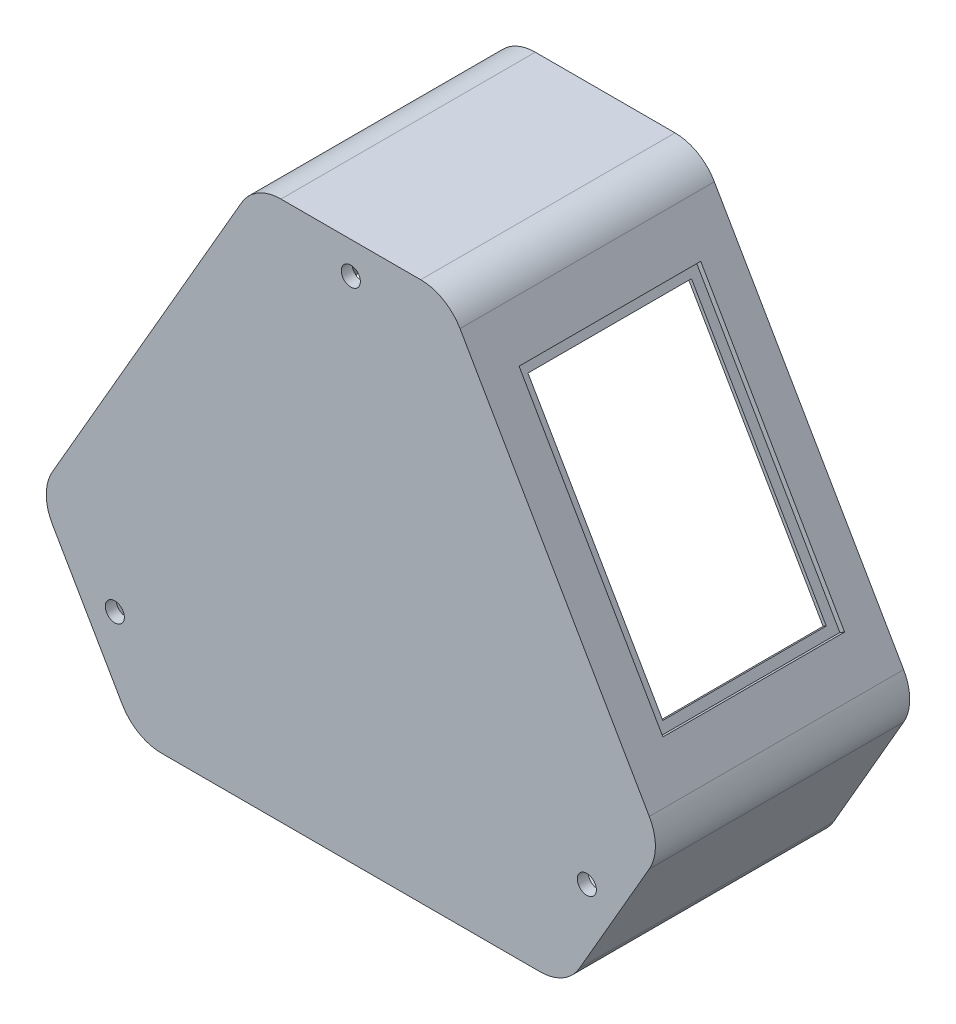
ISO-10303-21;
HEADER;
FILE_DESCRIPTION(('STEP AP214'),'2;1');
FILE_NAME('part.step','',(''),(''),'','','');
FILE_SCHEMA(('AUTOMOTIVE_DESIGN { 1 0 10303 214 1 1 1 1 }'));
ENDSEC;
DATA;
#1=APPLICATION_CONTEXT('core data for automotive mechanical design processes');
#2=APPLICATION_PROTOCOL_DEFINITION('international standard','automotive_design',2000,#1);
#3=PRODUCT_CONTEXT('',#1,'mechanical');
#4=PRODUCT('Part','Part','',(#3));
#5=PRODUCT_RELATED_PRODUCT_CATEGORY('part','',(#4));
#6=PRODUCT_DEFINITION_FORMATION('','',#4);
#7=PRODUCT_DEFINITION_CONTEXT('part definition',#1,'design');
#8=PRODUCT_DEFINITION('design','',#6,#7);
#9=PRODUCT_DEFINITION_SHAPE('','',#8);
#10=(LENGTH_UNIT() NAMED_UNIT(*) SI_UNIT(.MILLI.,.METRE.));
#11=(NAMED_UNIT(*) PLANE_ANGLE_UNIT() SI_UNIT($,.RADIAN.));
#12=(NAMED_UNIT(*) SI_UNIT($,.STERADIAN.) SOLID_ANGLE_UNIT());
#13=UNCERTAINTY_MEASURE_WITH_UNIT(LENGTH_MEASURE(1.E-05),#10,'distance_accuracy_value','');
#14=(GEOMETRIC_REPRESENTATION_CONTEXT(3) GLOBAL_UNCERTAINTY_ASSIGNED_CONTEXT((#13)) GLOBAL_UNIT_ASSIGNED_CONTEXT((#10,
#11,#12)) REPRESENTATION_CONTEXT('',''));
#15=CARTESIAN_POINT('',(0.,0.,0.));
#16=DIRECTION('',(0.,0.,1.));
#17=DIRECTION('',(1.,0.,0.));
#18=AXIS2_PLACEMENT_3D('',#15,#16,#17);
#19=CARTESIAN_POINT('',(0.,0.,6.));
#20=DIRECTION('',(0.,0.,1.));
#21=DIRECTION('',(1.,0.,0.));
#22=AXIS2_PLACEMENT_3D('',#19,#20,#21);
#23=PLANE('',#22);
#24=CARTESIAN_POINT('',(0.,150.,6.));
#25=DIRECTION('',(0.,0.,1.));
#26=DIRECTION('',(1.,0.,0.));
#27=AXIS2_PLACEMENT_3D('',#24,#25,#26);
#28=CIRCLE('',#27,5.25);
#29=CARTESIAN_POINT('',(5.25,150.,6.));
#30=VERTEX_POINT('',#29);
#31=EDGE_CURVE('E605',#30,#30,#28,.T.);
#32=ORIENTED_EDGE('',*,*,#31,.F.);
#33=EDGE_LOOP('',(#32));
#34=FACE_BOUND('',#33,.T.);
#35=CARTESIAN_POINT('',(129.903810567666,-75.,6.));
#36=DIRECTION('',(0.,0.,1.));
#37=DIRECTION('',(1.,0.,0.));
#38=AXIS2_PLACEMENT_3D('',#35,#36,#37);
#39=CIRCLE('',#38,5.25);
#40=CARTESIAN_POINT('',(135.153810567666,-75.,6.));
#41=VERTEX_POINT('',#40);
#42=EDGE_CURVE('E611',#41,#41,#39,.T.);
#43=ORIENTED_EDGE('',*,*,#42,.F.);
#44=EDGE_LOOP('',(#43));
#45=FACE_BOUND('',#44,.T.);
#46=CARTESIAN_POINT('',(-129.903810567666,-75.0000000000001,6.));
#47=DIRECTION('',(0.,0.,1.));
#48=DIRECTION('',(1.,0.,0.));
#49=AXIS2_PLACEMENT_3D('',#46,#47,#48);
#50=CIRCLE('',#49,5.25);
#51=CARTESIAN_POINT('',(-124.653810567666,-75.0000000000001,6.));
#52=VERTEX_POINT('',#51);
#53=EDGE_CURVE('E579',#52,#52,#50,.T.);
#54=ORIENTED_EDGE('',*,*,#53,.F.);
#55=EDGE_LOOP('',(#54));
#56=FACE_BOUND('',#55,.T.);
#57=CARTESIAN_POINT('',(38.4529946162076,142.5,6.));
#58=DIRECTION('',(0.,0.,1.));
#59=DIRECTION('',(1.,0.,0.));
#60=AXIS2_PLACEMENT_3D('',#57,#58,#59);
#61=CIRCLE('',#60,25.);
#62=CARTESIAN_POINT('',(60.1036297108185,155.,6.));
#63=VERTEX_POINT('',#62);
#64=CARTESIAN_POINT('',(38.4529946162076,167.5,6.));
#65=VERTEX_POINT('',#64);
#66=EDGE_CURVE('E473',#63,#65,#61,.T.);
#67=ORIENTED_EDGE('',*,*,#66,.T.);
#68=DIRECTION('',(-1.,0.,0.));
#69=VECTOR('',#68,1.);
#70=CARTESIAN_POINT('',(38.4529946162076,167.5,6.));
#71=LINE('',#70,#69);
#72=CARTESIAN_POINT('',(-38.4529946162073,167.5,6.));
#73=VERTEX_POINT('',#72);
#74=EDGE_CURVE('E545',#65,#73,#71,.T.);
#75=ORIENTED_EDGE('',*,*,#74,.T.);
#76=CARTESIAN_POINT('',(-38.4529946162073,142.5,6.));
#77=DIRECTION('',(0.,0.,1.));
#78=DIRECTION('',(1.,0.,0.));
#79=AXIS2_PLACEMENT_3D('',#76,#77,#78);
#80=CIRCLE('',#79,25.);
#81=CARTESIAN_POINT('',(-60.1036297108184,155.,6.));
#82=VERTEX_POINT('',#81);
#83=EDGE_CURVE('E548',#73,#82,#80,.T.);
#84=ORIENTED_EDGE('',*,*,#83,.T.);
#85=DIRECTION('',(-0.499999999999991,-0.866025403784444,0.));
#86=VECTOR('',#85,1.);
#87=CARTESIAN_POINT('',(-60.1036297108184,155.,6.));
#88=LINE('',#87,#86);
#89=CARTESIAN_POINT('',(-164.285752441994,-25.4487298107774,6.));
#90=VERTEX_POINT('',#89);
#91=EDGE_CURVE('E551',#82,#90,#88,.T.);
#92=ORIENTED_EDGE('',*,*,#91,.T.);
#93=CARTESIAN_POINT('',(-142.635117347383,-37.9487298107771,6.));
#94=DIRECTION('',(0.,0.,1.));
#95=DIRECTION('',(1.,0.,0.));
#96=AXIS2_PLACEMENT_3D('',#93,#94,#95);
#97=CIRCLE('',#96,25.);
#98=CARTESIAN_POINT('',(-164.285752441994,-50.4487298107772,6.));
#99=VERTEX_POINT('',#98);
#100=EDGE_CURVE('E554',#90,#99,#97,.T.);
#101=ORIENTED_EDGE('',*,*,#100,.T.);
#102=DIRECTION('',(0.500000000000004,-0.866025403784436,0.));
#103=VECTOR('',#102,1.);
#104=CARTESIAN_POINT('',(-164.285752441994,-50.4487298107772,6.));
#105=LINE('',#104,#103);
#106=CARTESIAN_POINT('',(-125.832757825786,-117.051270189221,6.));
#107=VERTEX_POINT('',#106);
#108=EDGE_CURVE('E557',#99,#107,#105,.T.);
#109=ORIENTED_EDGE('',*,*,#108,.T.);
#110=CARTESIAN_POINT('',(-104.182122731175,-104.551270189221,6.));
#111=DIRECTION('',(0.,0.,1.));
#112=DIRECTION('',(1.,0.,0.));
#113=AXIS2_PLACEMENT_3D('',#110,#111,#112);
#114=CIRCLE('',#113,25.);
#115=CARTESIAN_POINT('',(-104.182122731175,-129.551270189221,6.));
#116=VERTEX_POINT('',#115);
#117=EDGE_CURVE('E560',#107,#116,#114,.T.);
#118=ORIENTED_EDGE('',*,*,#117,.T.);
#119=DIRECTION('',(1.,0.,0.));
#120=VECTOR('',#119,1.);
#121=CARTESIAN_POINT('',(-104.182122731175,-129.551270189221,6.));
#122=LINE('',#121,#120);
#123=CARTESIAN_POINT('',(104.18212273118,-129.551270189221,6.));
#124=VERTEX_POINT('',#123);
#125=EDGE_CURVE('E563',#116,#124,#122,.T.);
#126=ORIENTED_EDGE('',*,*,#125,.T.);
#127=CARTESIAN_POINT('',(104.18212273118,-104.551270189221,6.));
#128=DIRECTION('',(0.,0.,1.));
#129=DIRECTION('',(1.,0.,0.));
#130=AXIS2_PLACEMENT_3D('',#127,#128,#129);
#131=CIRCLE('',#130,25.);
#132=CARTESIAN_POINT('',(125.832757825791,-117.051270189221,6.));
#133=VERTEX_POINT('',#132);
#134=EDGE_CURVE('E566',#124,#133,#131,.T.);
#135=ORIENTED_EDGE('',*,*,#134,.T.);
#136=DIRECTION('',(0.499999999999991,0.866025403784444,0.));
#137=VECTOR('',#136,1.);
#138=CARTESIAN_POINT('',(125.832757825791,-117.051270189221,6.));
#139=LINE('',#138,#137);
#140=CARTESIAN_POINT('',(164.285752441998,-50.4487298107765,6.));
#141=VERTEX_POINT('',#140);
#142=EDGE_CURVE('E569',#133,#141,#139,.T.);
#143=ORIENTED_EDGE('',*,*,#142,.T.);
#144=CARTESIAN_POINT('',(142.635117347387,-37.9487298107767,6.));
#145=DIRECTION('',(0.,0.,1.));
#146=DIRECTION('',(1.,0.,0.));
#147=AXIS2_PLACEMENT_3D('',#144,#145,#146);
#148=CIRCLE('',#147,25.);
#149=CARTESIAN_POINT('',(164.285752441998,-25.4487298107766,6.));
#150=VERTEX_POINT('',#149);
#151=EDGE_CURVE('E572',#141,#150,#148,.T.);
#152=ORIENTED_EDGE('',*,*,#151,.T.);
#153=DIRECTION('',(-0.500000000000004,0.866025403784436,0.));
#154=VECTOR('',#153,1.);
#155=CARTESIAN_POINT('',(164.285752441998,-25.4487298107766,6.));
#156=LINE('',#155,#154);
#157=EDGE_CURVE('E509',#150,#63,#156,.T.);
#158=ORIENTED_EDGE('',*,*,#157,.T.);
#159=EDGE_LOOP('',(#67,#75,#84,#92,#101,#109,#118,#126,#135,#143,#152,#158));
#160=FACE_BOUND('',#159,.T.);
#161=ADVANCED_FACE('F49',(#34,#45,#56,#160),#23,.T.);
#162=CARTESIAN_POINT('',(0.,0.,0.));
#163=DIRECTION('',(0.,0.,1.));
#164=DIRECTION('',(1.,0.,0.));
#165=AXIS2_PLACEMENT_3D('',#162,#163,#164);
#166=PLANE('',#165);
#167=CARTESIAN_POINT('',(0.,150.,0.));
#168=DIRECTION('',(0.,0.,1.));
#169=DIRECTION('',(1.,0.,0.));
#170=AXIS2_PLACEMENT_3D('',#167,#168,#169);
#171=CIRCLE('',#170,5.25);
#172=CARTESIAN_POINT('',(5.25,150.,0.));
#173=VERTEX_POINT('',#172);
#174=EDGE_CURVE('E601',#173,#173,#171,.T.);
#175=ORIENTED_EDGE('',*,*,#174,.T.);
#176=EDGE_LOOP('',(#175));
#177=FACE_BOUND('',#176,.T.);
#178=CARTESIAN_POINT('',(129.903810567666,-75.,0.));
#179=DIRECTION('',(0.,0.,1.));
#180=DIRECTION('',(1.,0.,0.));
#181=AXIS2_PLACEMENT_3D('',#178,#179,#180);
#182=CIRCLE('',#181,5.25);
#183=CARTESIAN_POINT('',(135.153810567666,-75.,0.));
#184=VERTEX_POINT('',#183);
#185=EDGE_CURVE('E608',#184,#184,#182,.T.);
#186=ORIENTED_EDGE('',*,*,#185,.T.);
#187=EDGE_LOOP('',(#186));
#188=FACE_BOUND('',#187,.T.);
#189=CARTESIAN_POINT('',(-129.903810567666,-75.0000000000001,0.));
#190=DIRECTION('',(0.,0.,1.));
#191=DIRECTION('',(1.,0.,0.));
#192=AXIS2_PLACEMENT_3D('',#189,#190,#191);
#193=CIRCLE('',#192,5.25);
#194=CARTESIAN_POINT('',(-124.653810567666,-75.0000000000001,0.));
#195=VERTEX_POINT('',#194);
#196=EDGE_CURVE('E614',#195,#195,#193,.T.);
#197=ORIENTED_EDGE('',*,*,#196,.T.);
#198=EDGE_LOOP('',(#197));
#199=FACE_BOUND('',#198,.T.);
#200=DIRECTION('',(-0.499999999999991,-0.866025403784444,0.));
#201=VECTOR('',#200,1.);
#202=CARTESIAN_POINT('',(-107.864564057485,62.2756350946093,0.));
#203=LINE('',#202,#201);
#204=CARTESIAN_POINT('',(-55.7735026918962,152.5,0.));
#205=VERTEX_POINT('',#204);
#206=CARTESIAN_POINT('',(-159.955625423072,-27.9487298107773,0.));
#207=VERTEX_POINT('',#206);
#208=EDGE_CURVE('E604',#205,#207,#203,.T.);
#209=ORIENTED_EDGE('',*,*,#208,.F.);
#210=CARTESIAN_POINT('',(-38.4529946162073,142.5,0.));
#211=DIRECTION('',(0.,0.,1.));
#212=DIRECTION('',(1.,0.,0.));
#213=AXIS2_PLACEMENT_3D('',#210,#211,#212);
#214=CIRCLE('',#213,20.);
#215=CARTESIAN_POINT('',(-38.4529946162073,162.5,0.));
#216=VERTEX_POINT('',#215);
#217=EDGE_CURVE('E11',#205,#216,#214,.F.);
#218=ORIENTED_EDGE('',*,*,#217,.T.);
#219=DIRECTION('',(1.,0.,0.));
#220=VECTOR('',#219,1.);
#221=CARTESIAN_POINT('',(0.,162.5,0.));
#222=LINE('',#221,#220);
#223=CARTESIAN_POINT('',(38.4529946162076,162.5,0.));
#224=VERTEX_POINT('',#223);
#225=EDGE_CURVE('E630',#216,#224,#222,.T.);
#226=ORIENTED_EDGE('',*,*,#225,.T.);
#227=CARTESIAN_POINT('',(38.4529946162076,142.5,0.));
#228=DIRECTION('',(0.,0.,1.));
#229=DIRECTION('',(1.,0.,0.));
#230=AXIS2_PLACEMENT_3D('',#227,#228,#229);
#231=CIRCLE('',#230,20.);
#232=CARTESIAN_POINT('',(55.7735026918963,152.5,0.));
#233=VERTEX_POINT('',#232);
#234=EDGE_CURVE('E57',#224,#233,#231,.F.);
#235=ORIENTED_EDGE('',*,*,#234,.T.);
#236=DIRECTION('',(0.500000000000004,-0.866025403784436,0.));
#237=VECTOR('',#236,1.);
#238=CARTESIAN_POINT('',(107.864564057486,62.2756350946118,0.));
#239=LINE('',#238,#237);
#240=CARTESIAN_POINT('',(159.955625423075,-27.9487298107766,0.));
#241=VERTEX_POINT('',#240);
#242=EDGE_CURVE('E627',#233,#241,#239,.T.);
#243=ORIENTED_EDGE('',*,*,#242,.T.);
#244=CARTESIAN_POINT('',(142.635117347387,-37.9487298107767,0.));
#245=DIRECTION('',(0.,0.,1.));
#246=DIRECTION('',(1.,0.,0.));
#247=AXIS2_PLACEMENT_3D('',#244,#245,#246);
#248=CIRCLE('',#247,20.);
#249=CARTESIAN_POINT('',(159.955625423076,-47.9487298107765,0.));
#250=VERTEX_POINT('',#249);
#251=EDGE_CURVE('E642',#241,#250,#248,.F.);
#252=ORIENTED_EDGE('',*,*,#251,.T.);
#253=DIRECTION('',(-0.499999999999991,-0.866025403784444,0.));
#254=VECTOR('',#253,1.);
#255=CARTESIAN_POINT('',(140.729128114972,-81.2499999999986,0.));
#256=LINE('',#255,#254);
#257=CARTESIAN_POINT('',(121.502630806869,-114.551270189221,0.));
#258=VERTEX_POINT('',#257);
#259=EDGE_CURVE('E624',#250,#258,#256,.T.);
#260=ORIENTED_EDGE('',*,*,#259,.T.);
#261=CARTESIAN_POINT('',(104.18212273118,-104.551270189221,0.));
#262=DIRECTION('',(0.,0.,1.));
#263=DIRECTION('',(1.,0.,0.));
#264=AXIS2_PLACEMENT_3D('',#261,#262,#263);
#265=CIRCLE('',#264,20.);
#266=CARTESIAN_POINT('',(104.18212273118,-124.551270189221,0.));
#267=VERTEX_POINT('',#266);
#268=EDGE_CURVE('E639',#258,#267,#265,.F.);
#269=ORIENTED_EDGE('',*,*,#268,.T.);
#270=DIRECTION('',(1.,0.,0.));
#271=VECTOR('',#270,1.);
#272=CARTESIAN_POINT('',(0.,-124.551270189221,0.));
#273=LINE('',#272,#271);
#274=CARTESIAN_POINT('',(-104.182122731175,-124.551270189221,0.));
#275=VERTEX_POINT('',#274);
#276=EDGE_CURVE('E622',#275,#267,#273,.T.);
#277=ORIENTED_EDGE('',*,*,#276,.F.);
#278=CARTESIAN_POINT('',(-104.182122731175,-104.551270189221,0.));
#279=DIRECTION('',(0.,0.,1.));
#280=DIRECTION('',(1.,0.,0.));
#281=AXIS2_PLACEMENT_3D('',#278,#279,#280);
#282=CIRCLE('',#281,20.);
#283=CARTESIAN_POINT('',(-121.502630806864,-114.551270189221,0.));
#284=VERTEX_POINT('',#283);
#285=EDGE_CURVE('E633',#275,#284,#282,.F.);
#286=ORIENTED_EDGE('',*,*,#285,.T.);
#287=DIRECTION('',(0.500000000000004,-0.866025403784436,0.));
#288=VECTOR('',#287,1.);
#289=CARTESIAN_POINT('',(-140.729128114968,-81.249999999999,0.));
#290=LINE('',#289,#288);
#291=CARTESIAN_POINT('',(-159.955625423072,-47.9487298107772,0.));
#292=VERTEX_POINT('',#291);
#293=EDGE_CURVE('E620',#292,#284,#290,.T.);
#294=ORIENTED_EDGE('',*,*,#293,.F.);
#295=CARTESIAN_POINT('',(-142.635117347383,-37.9487298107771,0.));
#296=DIRECTION('',(0.,0.,1.));
#297=DIRECTION('',(1.,0.,0.));
#298=AXIS2_PLACEMENT_3D('',#295,#296,#297);
#299=CIRCLE('',#298,20.);
#300=EDGE_CURVE('E636',#292,#207,#299,.F.);
#301=ORIENTED_EDGE('',*,*,#300,.T.);
#302=EDGE_LOOP('',(#209,#218,#226,#235,#243,#252,#260,#269,#277,#286,#294,#301));
#303=FACE_BOUND('',#302,.T.);
#304=ADVANCED_FACE('F51',(#177,#188,#199,#303),#166,.F.);
#305=CARTESIAN_POINT('',(-129.903810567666,-75.0000000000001,0.));
#306=DIRECTION('',(0.,0.,1.));
#307=DIRECTION('',(1.,0.,0.));
#308=AXIS2_PLACEMENT_3D('',#305,#306,#307);
#309=CYLINDRICAL_SURFACE('',#308,5.25);
#310=ORIENTED_EDGE('',*,*,#196,.F.);
#311=EDGE_LOOP('',(#310));
#312=FACE_BOUND('',#311,.T.);
#313=ORIENTED_EDGE('',*,*,#53,.T.);
#314=EDGE_LOOP('',(#313));
#315=FACE_BOUND('',#314,.T.);
#316=ADVANCED_FACE('F745',(#312,#315),#309,.F.);
#317=CARTESIAN_POINT('',(129.903810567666,-75.,0.));
#318=DIRECTION('',(0.,0.,1.));
#319=DIRECTION('',(1.,0.,0.));
#320=AXIS2_PLACEMENT_3D('',#317,#318,#319);
#321=CYLINDRICAL_SURFACE('',#320,5.25);
#322=ORIENTED_EDGE('',*,*,#185,.F.);
#323=EDGE_LOOP('',(#322));
#324=FACE_BOUND('',#323,.T.);
#325=ORIENTED_EDGE('',*,*,#42,.T.);
#326=EDGE_LOOP('',(#325));
#327=FACE_BOUND('',#326,.T.);
#328=ADVANCED_FACE('F752',(#324,#327),#321,.F.);
#329=CARTESIAN_POINT('',(0.,150.,0.));
#330=DIRECTION('',(0.,0.,1.));
#331=DIRECTION('',(1.,0.,0.));
#332=AXIS2_PLACEMENT_3D('',#329,#330,#331);
#333=CYLINDRICAL_SURFACE('',#332,5.25);
#334=ORIENTED_EDGE('',*,*,#174,.F.);
#335=EDGE_LOOP('',(#334));
#336=FACE_BOUND('',#335,.T.);
#337=ORIENTED_EDGE('',*,*,#31,.T.);
#338=EDGE_LOOP('',(#337));
#339=FACE_BOUND('',#338,.T.);
#340=ADVANCED_FACE('F756',(#336,#339),#333,.F.);
#341=CARTESIAN_POINT('',(38.4529946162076,142.5,-134.));
#342=DIRECTION('',(0.,0.,1.));
#343=DIRECTION('',(1.,0.,0.));
#344=AXIS2_PLACEMENT_3D('',#341,#342,#343);
#345=CYLINDRICAL_SURFACE('',#344,20.);
#346=DIRECTION('',(0.,0.,1.));
#347=VECTOR('',#346,1.);
#348=CARTESIAN_POINT('',(55.7735026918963,152.5,-134.));
#349=LINE('',#348,#347);
#350=CARTESIAN_POINT('',(55.7735026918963,152.5,-134.));
#351=VERTEX_POINT('',#350);
#352=EDGE_CURVE('E470',#351,#233,#349,.T.);
#353=ORIENTED_EDGE('',*,*,#352,.T.);
#354=ORIENTED_EDGE('',*,*,#234,.F.);
#355=DIRECTION('',(0.,0.,1.));
#356=VECTOR('',#355,1.);
#357=CARTESIAN_POINT('',(38.4529946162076,162.5,-134.));
#358=LINE('',#357,#356);
#359=CARTESIAN_POINT('',(38.4529946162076,162.5,-134.));
#360=VERTEX_POINT('',#359);
#361=EDGE_CURVE('E469',#360,#224,#358,.T.);
#362=ORIENTED_EDGE('',*,*,#361,.F.);
#363=CARTESIAN_POINT('',(38.4529946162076,142.5,-134.));
#364=DIRECTION('',(0.,0.,1.));
#365=DIRECTION('',(1.,0.,0.));
#366=AXIS2_PLACEMENT_3D('',#363,#364,#365);
#367=CIRCLE('',#366,20.);
#368=EDGE_CURVE('E427',#351,#360,#367,.T.);
#369=ORIENTED_EDGE('',*,*,#368,.F.);
#370=EDGE_LOOP('',(#353,#354,#362,#369));
#371=FACE_BOUND('',#370,.T.);
#372=ADVANCED_FACE('F649',(#371),#345,.F.);
#373=CARTESIAN_POINT('',(142.635117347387,-37.9487298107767,-134.));
#374=DIRECTION('',(0.,0.,1.));
#375=DIRECTION('',(1.,0.,0.));
#376=AXIS2_PLACEMENT_3D('',#373,#374,#375);
#377=CYLINDRICAL_SURFACE('',#376,20.);
#378=DIRECTION('',(0.,0.,1.));
#379=VECTOR('',#378,1.);
#380=CARTESIAN_POINT('',(159.955625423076,-47.9487298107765,-134.));
#381=LINE('',#380,#379);
#382=CARTESIAN_POINT('',(159.955625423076,-47.9487298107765,-134.));
#383=VERTEX_POINT('',#382);
#384=EDGE_CURVE('E477',#383,#250,#381,.T.);
#385=ORIENTED_EDGE('',*,*,#384,.T.);
#386=ORIENTED_EDGE('',*,*,#251,.F.);
#387=DIRECTION('',(0.,0.,1.));
#388=VECTOR('',#387,1.);
#389=CARTESIAN_POINT('',(159.955625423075,-27.9487298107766,-134.));
#390=LINE('',#389,#388);
#391=CARTESIAN_POINT('',(159.955625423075,-27.9487298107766,-134.));
#392=VERTEX_POINT('',#391);
#393=EDGE_CURVE('E474',#392,#241,#390,.T.);
#394=ORIENTED_EDGE('',*,*,#393,.F.);
#395=CARTESIAN_POINT('',(142.635117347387,-37.9487298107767,-134.));
#396=DIRECTION('',(0.,0.,1.));
#397=DIRECTION('',(1.,0.,0.));
#398=AXIS2_PLACEMENT_3D('',#395,#396,#397);
#399=CIRCLE('',#398,20.);
#400=EDGE_CURVE('E463',#383,#392,#399,.T.);
#401=ORIENTED_EDGE('',*,*,#400,.F.);
#402=EDGE_LOOP('',(#385,#386,#394,#401));
#403=FACE_BOUND('',#402,.T.);
#404=ADVANCED_FACE('F655',(#403),#377,.F.);
#405=CARTESIAN_POINT('',(104.18212273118,-104.551270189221,-134.));
#406=DIRECTION('',(0.,0.,1.));
#407=DIRECTION('',(1.,0.,0.));
#408=AXIS2_PLACEMENT_3D('',#405,#406,#407);
#409=CYLINDRICAL_SURFACE('',#408,20.);
#410=DIRECTION('',(0.,0.,1.));
#411=VECTOR('',#410,1.);
#412=CARTESIAN_POINT('',(104.18212273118,-124.551270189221,-134.));
#413=LINE('',#412,#411);
#414=CARTESIAN_POINT('',(104.18212273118,-124.551270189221,-134.));
#415=VERTEX_POINT('',#414);
#416=EDGE_CURVE('E483',#415,#267,#413,.T.);
#417=ORIENTED_EDGE('',*,*,#416,.T.);
#418=ORIENTED_EDGE('',*,*,#268,.F.);
#419=DIRECTION('',(0.,0.,1.));
#420=VECTOR('',#419,1.);
#421=CARTESIAN_POINT('',(121.502630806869,-114.551270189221,-134.));
#422=LINE('',#421,#420);
#423=CARTESIAN_POINT('',(121.502630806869,-114.551270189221,-134.));
#424=VERTEX_POINT('',#423);
#425=EDGE_CURVE('E480',#424,#258,#422,.T.);
#426=ORIENTED_EDGE('',*,*,#425,.F.);
#427=CARTESIAN_POINT('',(104.18212273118,-104.551270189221,-134.));
#428=DIRECTION('',(0.,0.,1.));
#429=DIRECTION('',(1.,0.,0.));
#430=AXIS2_PLACEMENT_3D('',#427,#428,#429);
#431=CIRCLE('',#430,20.);
#432=EDGE_CURVE('E457',#415,#424,#431,.T.);
#433=ORIENTED_EDGE('',*,*,#432,.F.);
#434=EDGE_LOOP('',(#417,#418,#426,#433));
#435=FACE_BOUND('',#434,.T.);
#436=ADVANCED_FACE('F662',(#435),#409,.F.);
#437=CARTESIAN_POINT('',(-104.182122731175,-104.551270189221,-134.));
#438=DIRECTION('',(0.,0.,1.));
#439=DIRECTION('',(1.,0.,0.));
#440=AXIS2_PLACEMENT_3D('',#437,#438,#439);
#441=CYLINDRICAL_SURFACE('',#440,20.);
#442=DIRECTION('',(0.,0.,1.));
#443=VECTOR('',#442,1.);
#444=CARTESIAN_POINT('',(-121.502630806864,-114.551270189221,-134.));
#445=LINE('',#444,#443);
#446=CARTESIAN_POINT('',(-121.502630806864,-114.551270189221,-134.));
#447=VERTEX_POINT('',#446);
#448=EDGE_CURVE('E489',#447,#284,#445,.T.);
#449=ORIENTED_EDGE('',*,*,#448,.T.);
#450=ORIENTED_EDGE('',*,*,#285,.F.);
#451=DIRECTION('',(0.,0.,1.));
#452=VECTOR('',#451,1.);
#453=CARTESIAN_POINT('',(-104.182122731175,-124.551270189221,-134.));
#454=LINE('',#453,#452);
#455=CARTESIAN_POINT('',(-104.182122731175,-124.551270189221,-134.));
#456=VERTEX_POINT('',#455);
#457=EDGE_CURVE('E486',#456,#275,#454,.T.);
#458=ORIENTED_EDGE('',*,*,#457,.F.);
#459=CARTESIAN_POINT('',(-104.182122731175,-104.551270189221,-134.));
#460=DIRECTION('',(0.,0.,1.));
#461=DIRECTION('',(1.,0.,0.));
#462=AXIS2_PLACEMENT_3D('',#459,#460,#461);
#463=CIRCLE('',#462,20.);
#464=EDGE_CURVE('E451',#447,#456,#463,.T.);
#465=ORIENTED_EDGE('',*,*,#464,.F.);
#466=EDGE_LOOP('',(#449,#450,#458,#465));
#467=FACE_BOUND('',#466,.T.);
#468=ADVANCED_FACE('F668',(#467),#441,.F.);
#469=CARTESIAN_POINT('',(-142.635117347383,-37.9487298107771,-134.));
#470=DIRECTION('',(0.,0.,1.));
#471=DIRECTION('',(1.,0.,0.));
#472=AXIS2_PLACEMENT_3D('',#469,#470,#471);
#473=CYLINDRICAL_SURFACE('',#472,20.);
#474=DIRECTION('',(0.,0.,1.));
#475=VECTOR('',#474,1.);
#476=CARTESIAN_POINT('',(-159.955625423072,-27.9487298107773,-134.));
#477=LINE('',#476,#475);
#478=CARTESIAN_POINT('',(-159.955625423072,-27.9487298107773,-134.));
#479=VERTEX_POINT('',#478);
#480=EDGE_CURVE('E495',#479,#207,#477,.T.);
#481=ORIENTED_EDGE('',*,*,#480,.T.);
#482=ORIENTED_EDGE('',*,*,#300,.F.);
#483=DIRECTION('',(0.,0.,1.));
#484=VECTOR('',#483,1.);
#485=CARTESIAN_POINT('',(-159.955625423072,-47.9487298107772,-134.));
#486=LINE('',#485,#484);
#487=CARTESIAN_POINT('',(-159.955625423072,-47.9487298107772,-134.));
#488=VERTEX_POINT('',#487);
#489=EDGE_CURVE('E492',#488,#292,#486,.T.);
#490=ORIENTED_EDGE('',*,*,#489,.F.);
#491=CARTESIAN_POINT('',(-142.635117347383,-37.9487298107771,-134.));
#492=DIRECTION('',(0.,0.,1.));
#493=DIRECTION('',(1.,0.,0.));
#494=AXIS2_PLACEMENT_3D('',#491,#492,#493);
#495=CIRCLE('',#494,20.);
#496=EDGE_CURVE('E445',#479,#488,#495,.T.);
#497=ORIENTED_EDGE('',*,*,#496,.F.);
#498=EDGE_LOOP('',(#481,#482,#490,#497));
#499=FACE_BOUND('',#498,.T.);
#500=ADVANCED_FACE('F675',(#499),#473,.F.);
#501=CARTESIAN_POINT('',(-38.4529946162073,142.5,-134.));
#502=DIRECTION('',(0.,0.,1.));
#503=DIRECTION('',(1.,0.,0.));
#504=AXIS2_PLACEMENT_3D('',#501,#502,#503);
#505=CYLINDRICAL_SURFACE('',#504,20.);
#506=DIRECTION('',(0.,0.,1.));
#507=VECTOR('',#506,1.);
#508=CARTESIAN_POINT('',(-38.4529946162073,162.5,-134.));
#509=LINE('',#508,#507);
#510=CARTESIAN_POINT('',(-38.4529946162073,162.5,-134.));
#511=VERTEX_POINT('',#510);
#512=EDGE_CURVE('E501',#511,#216,#509,.T.);
#513=ORIENTED_EDGE('',*,*,#512,.T.);
#514=ORIENTED_EDGE('',*,*,#217,.F.);
#515=DIRECTION('',(0.,0.,1.));
#516=VECTOR('',#515,1.);
#517=CARTESIAN_POINT('',(-55.7735026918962,152.5,-134.));
#518=LINE('',#517,#516);
#519=CARTESIAN_POINT('',(-55.7735026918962,152.5,-134.));
#520=VERTEX_POINT('',#519);
#521=EDGE_CURVE('E498',#520,#205,#518,.T.);
#522=ORIENTED_EDGE('',*,*,#521,.F.);
#523=CARTESIAN_POINT('',(-38.4529946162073,142.5,-134.));
#524=DIRECTION('',(0.,0.,1.));
#525=DIRECTION('',(1.,0.,0.));
#526=AXIS2_PLACEMENT_3D('',#523,#524,#525);
#527=CIRCLE('',#526,20.);
#528=EDGE_CURVE('E439',#511,#520,#527,.T.);
#529=ORIENTED_EDGE('',*,*,#528,.F.);
#530=EDGE_LOOP('',(#513,#514,#522,#529));
#531=FACE_BOUND('',#530,.T.);
#532=ADVANCED_FACE('F680',(#531),#505,.F.);
#533=CARTESIAN_POINT('',(38.4529946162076,162.5,-134.));
#534=DIRECTION('',(0.,1.,0.));
#535=DIRECTION('',(0.,0.,1.));
#536=AXIS2_PLACEMENT_3D('',#533,#534,#535);
#537=PLANE('',#536);
#538=ORIENTED_EDGE('',*,*,#361,.T.);
#539=ORIENTED_EDGE('',*,*,#225,.F.);
#540=ORIENTED_EDGE('',*,*,#512,.F.);
#541=DIRECTION('',(-1.,0.,0.));
#542=VECTOR('',#541,1.);
#543=CARTESIAN_POINT('',(38.4529946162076,162.5,-134.));
#544=LINE('',#543,#542);
#545=EDGE_CURVE('E436',#360,#511,#544,.T.);
#546=ORIENTED_EDGE('',*,*,#545,.F.);
#547=EDGE_LOOP('',(#538,#539,#540,#546));
#548=FACE_BOUND('',#547,.T.);
#549=ADVANCED_FACE('F683',(#548),#537,.F.);
#550=CARTESIAN_POINT('',(159.955625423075,-27.9487298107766,-134.));
#551=DIRECTION('',(0.866025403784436,0.500000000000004,0.));
#552=DIRECTION('',(-0.500000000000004,0.866025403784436,0.));
#553=AXIS2_PLACEMENT_3D('',#550,#551,#552);
#554=PLANE('',#553);
#555=DIRECTION('',(0.,0.,-1.));
#556=VECTOR('',#555,1.);
#557=CARTESIAN_POINT('',(144.954564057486,-1.9661293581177,-134.));
#558=LINE('',#557,#556);
#559=CARTESIAN_POINT('',(144.954564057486,-1.9661293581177,-18.9999999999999));
#560=VERTEX_POINT('',#559);
#561=CARTESIAN_POINT('',(144.954564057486,-1.9661293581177,-109.));
#562=VERTEX_POINT('',#561);
#563=EDGE_CURVE('E327',#560,#562,#558,.T.);
#564=ORIENTED_EDGE('',*,*,#563,.T.);
#565=DIRECTION('',(-0.500000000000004,0.866025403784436,0.));
#566=VECTOR('',#565,1.);
#567=CARTESIAN_POINT('',(159.955625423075,-27.9487298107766,-109.));
#568=LINE('',#567,#566);
#569=CARTESIAN_POINT('',(70.7745640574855,126.517399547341,-109.));
#570=VERTEX_POINT('',#569);
#571=EDGE_CURVE('E318',#562,#570,#568,.T.);
#572=ORIENTED_EDGE('',*,*,#571,.T.);
#573=DIRECTION('',(0.,0.,1.));
#574=VECTOR('',#573,1.);
#575=CARTESIAN_POINT('',(70.7745640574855,126.517399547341,-134.));
#576=LINE('',#575,#574);
#577=CARTESIAN_POINT('',(70.7745640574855,126.517399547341,-18.9999999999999));
#578=VERTEX_POINT('',#577);
#579=EDGE_CURVE('E304',#570,#578,#576,.T.);
#580=ORIENTED_EDGE('',*,*,#579,.T.);
#581=DIRECTION('',(0.500000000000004,-0.866025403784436,0.));
#582=VECTOR('',#581,1.);
#583=CARTESIAN_POINT('',(159.955625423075,-27.9487298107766,-18.9999999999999));
#584=LINE('',#583,#582);
#585=EDGE_CURVE('E312',#578,#560,#584,.T.);
#586=ORIENTED_EDGE('',*,*,#585,.T.);
#587=EDGE_LOOP('',(#564,#572,#580,#586));
#588=FACE_BOUND('',#587,.T.);
#589=ORIENTED_EDGE('',*,*,#393,.T.);
#590=ORIENTED_EDGE('',*,*,#242,.F.);
#591=ORIENTED_EDGE('',*,*,#352,.F.);
#592=DIRECTION('',(-0.500000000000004,0.866025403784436,0.));
#593=VECTOR('',#592,1.);
#594=CARTESIAN_POINT('',(159.955625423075,-27.9487298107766,-134.));
#595=LINE('',#594,#593);
#596=EDGE_CURVE('E466',#392,#351,#595,.T.);
#597=ORIENTED_EDGE('',*,*,#596,.F.);
#598=EDGE_LOOP('',(#589,#590,#591,#597));
#599=FACE_BOUND('',#598,.T.);
#600=ADVANCED_FACE('F325',(#588,#599),#554,.F.);
#601=CARTESIAN_POINT('',(121.502630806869,-114.551270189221,-134.));
#602=DIRECTION('',(0.866025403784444,-0.499999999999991,0.));
#603=DIRECTION('',(0.499999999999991,0.866025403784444,0.));
#604=AXIS2_PLACEMENT_3D('',#601,#602,#603);
#605=PLANE('',#604);
#606=ORIENTED_EDGE('',*,*,#425,.T.);
#607=ORIENTED_EDGE('',*,*,#259,.F.);
#608=ORIENTED_EDGE('',*,*,#384,.F.);
#609=DIRECTION('',(0.499999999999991,0.866025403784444,0.));
#610=VECTOR('',#609,1.);
#611=CARTESIAN_POINT('',(121.502630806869,-114.551270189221,-134.));
#612=LINE('',#611,#610);
#613=EDGE_CURVE('E460',#424,#383,#612,.T.);
#614=ORIENTED_EDGE('',*,*,#613,.F.);
#615=EDGE_LOOP('',(#606,#607,#608,#614));
#616=FACE_BOUND('',#615,.T.);
#617=ADVANCED_FACE('F658',(#616),#605,.F.);
#618=CARTESIAN_POINT('',(-55.7735026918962,152.5,-134.));
#619=DIRECTION('',(-0.866025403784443,0.499999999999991,0.));
#620=DIRECTION('',(-0.499999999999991,-0.866025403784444,0.));
#621=AXIS2_PLACEMENT_3D('',#618,#619,#620);
#622=PLANE('',#621);
#623=DIRECTION('',(0.,0.,-1.));
#624=VECTOR('',#623,1.);
#625=CARTESIAN_POINT('',(-70.7745640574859,126.517399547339,-109.));
#626=LINE('',#625,#624);
#627=CARTESIAN_POINT('',(-70.7745640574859,126.517399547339,-19.));
#628=VERTEX_POINT('',#627);
#629=CARTESIAN_POINT('',(-70.7745640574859,126.517399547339,-109.));
#630=VERTEX_POINT('',#629);
#631=EDGE_CURVE('E378',#628,#630,#626,.T.);
#632=ORIENTED_EDGE('',*,*,#631,.T.);
#633=DIRECTION('',(-0.499999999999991,-0.866025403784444,0.));
#634=VECTOR('',#633,1.);
#635=CARTESIAN_POINT('',(-70.7745640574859,126.517399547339,-109.));
#636=LINE('',#635,#634);
#637=CARTESIAN_POINT('',(-144.954564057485,-1.96612935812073,-109.));
#638=VERTEX_POINT('',#637);
#639=EDGE_CURVE('E364',#630,#638,#636,.T.);
#640=ORIENTED_EDGE('',*,*,#639,.T.);
#641=DIRECTION('',(0.,0.,1.));
#642=VECTOR('',#641,1.);
#643=CARTESIAN_POINT('',(-144.954564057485,-1.96612935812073,-109.));
#644=LINE('',#643,#642);
#645=CARTESIAN_POINT('',(-144.954564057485,-1.96612935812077,-19.));
#646=VERTEX_POINT('',#645);
#647=EDGE_CURVE('E372',#638,#646,#644,.T.);
#648=ORIENTED_EDGE('',*,*,#647,.T.);
#649=DIRECTION('',(0.499999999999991,0.866025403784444,0.));
#650=VECTOR('',#649,1.);
#651=CARTESIAN_POINT('',(-70.7745640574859,126.517399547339,-19.));
#652=LINE('',#651,#650);
#653=EDGE_CURVE('E375',#646,#628,#652,.T.);
#654=ORIENTED_EDGE('',*,*,#653,.T.);
#655=EDGE_LOOP('',(#632,#640,#648,#654));
#656=FACE_BOUND('',#655,.T.);
#657=ORIENTED_EDGE('',*,*,#521,.T.);
#658=ORIENTED_EDGE('',*,*,#208,.T.);
#659=ORIENTED_EDGE('',*,*,#480,.F.);
#660=DIRECTION('',(-0.499999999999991,-0.866025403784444,0.));
#661=VECTOR('',#660,1.);
#662=CARTESIAN_POINT('',(-55.7735026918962,152.5,-134.));
#663=LINE('',#662,#661);
#664=EDGE_CURVE('E442',#520,#479,#663,.T.);
#665=ORIENTED_EDGE('',*,*,#664,.F.);
#666=EDGE_LOOP('',(#657,#658,#659,#665));
#667=FACE_BOUND('',#666,.T.);
#668=ADVANCED_FACE('F677',(#656,#667),#622,.F.);
#669=CARTESIAN_POINT('',(-104.182122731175,-124.551270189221,-134.));
#670=DIRECTION('',(0.,-1.,0.));
#671=DIRECTION('',(0.,0.,-1.));
#672=AXIS2_PLACEMENT_3D('',#669,#670,#671);
#673=PLANE('',#672);
#674=ORIENTED_EDGE('',*,*,#457,.T.);
#675=ORIENTED_EDGE('',*,*,#276,.T.);
#676=ORIENTED_EDGE('',*,*,#416,.F.);
#677=DIRECTION('',(1.,0.,0.));
#678=VECTOR('',#677,1.);
#679=CARTESIAN_POINT('',(-104.182122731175,-124.551270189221,-134.));
#680=LINE('',#679,#678);
#681=EDGE_CURVE('E454',#456,#415,#680,.T.);
#682=ORIENTED_EDGE('',*,*,#681,.F.);
#683=EDGE_LOOP('',(#674,#675,#676,#682));
#684=FACE_BOUND('',#683,.T.);
#685=ADVANCED_FACE('F665',(#684),#673,.F.);
#686=CARTESIAN_POINT('',(-159.955625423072,-47.9487298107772,-134.));
#687=DIRECTION('',(-0.866025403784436,-0.500000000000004,0.));
#688=DIRECTION('',(0.500000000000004,-0.866025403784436,0.));
#689=AXIS2_PLACEMENT_3D('',#686,#687,#688);
#690=PLANE('',#689);
#691=ORIENTED_EDGE('',*,*,#489,.T.);
#692=ORIENTED_EDGE('',*,*,#293,.T.);
#693=ORIENTED_EDGE('',*,*,#448,.F.);
#694=DIRECTION('',(0.500000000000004,-0.866025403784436,0.));
#695=VECTOR('',#694,1.);
#696=CARTESIAN_POINT('',(-159.955625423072,-47.9487298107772,-134.));
#697=LINE('',#696,#695);
#698=EDGE_CURVE('E448',#488,#447,#697,.T.);
#699=ORIENTED_EDGE('',*,*,#698,.F.);
#700=EDGE_LOOP('',(#691,#692,#693,#699));
#701=FACE_BOUND('',#700,.T.);
#702=ADVANCED_FACE('F672',(#701),#690,.F.);
#703=CARTESIAN_POINT('',(38.4529946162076,142.5,-134.));
#704=DIRECTION('',(0.,0.,1.));
#705=DIRECTION('',(1.,0.,0.));
#706=AXIS2_PLACEMENT_3D('',#703,#704,#705);
#707=CYLINDRICAL_SURFACE('',#706,25.);
#708=ORIENTED_EDGE('',*,*,#66,.F.);
#709=DIRECTION('',(0.,0.,1.));
#710=VECTOR('',#709,1.);
#711=CARTESIAN_POINT('',(60.1036297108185,155.,-134.));
#712=LINE('',#711,#710);
#713=CARTESIAN_POINT('',(60.1036297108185,155.,-134.));
#714=VERTEX_POINT('',#713);
#715=EDGE_CURVE('E577',#714,#63,#712,.T.);
#716=ORIENTED_EDGE('',*,*,#715,.F.);
#717=CARTESIAN_POINT('',(38.4529946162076,142.5,-134.));
#718=DIRECTION('',(0.,0.,1.));
#719=DIRECTION('',(1.,0.,0.));
#720=AXIS2_PLACEMENT_3D('',#717,#718,#719);
#721=CIRCLE('',#720,25.);
#722=CARTESIAN_POINT('',(38.4529946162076,167.5,-134.));
#723=VERTEX_POINT('',#722);
#724=EDGE_CURVE('E505',#714,#723,#721,.T.);
#725=ORIENTED_EDGE('',*,*,#724,.T.);
#726=DIRECTION('',(0.,0.,1.));
#727=VECTOR('',#726,1.);
#728=CARTESIAN_POINT('',(38.4529946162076,167.5,-134.));
#729=LINE('',#728,#727);
#730=EDGE_CURVE('E542',#723,#65,#729,.T.);
#731=ORIENTED_EDGE('',*,*,#730,.T.);
#732=EDGE_LOOP('',(#708,#716,#725,#731));
#733=FACE_BOUND('',#732,.T.);
#734=ADVANCED_FACE('F737',(#733),#707,.T.);
#735=CARTESIAN_POINT('',(164.285752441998,-25.4487298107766,-134.));
#736=DIRECTION('',(0.866025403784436,0.500000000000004,0.));
#737=DIRECTION('',(-0.500000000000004,0.866025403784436,0.));
#738=AXIS2_PLACEMENT_3D('',#735,#736,#737);
#739=PLANE('',#738);
#740=DIRECTION('',(-0.500000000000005,0.866025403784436,0.));
#741=VECTOR('',#740,1.);
#742=CARTESIAN_POINT('',(151.784691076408,-3.79625637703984,-114.));
#743=LINE('',#742,#741);
#744=CARTESIAN_POINT('',(151.784691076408,-3.79625637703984,-114.));
#745=VERTEX_POINT('',#744);
#746=CARTESIAN_POINT('',(72.6046910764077,133.347526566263,-114.));
#747=VERTEX_POINT('',#746);
#748=EDGE_CURVE('E72',#745,#747,#743,.T.);
#749=ORIENTED_EDGE('',*,*,#748,.F.);
#750=DIRECTION('',(0.,0.,-1.));
#751=VECTOR('',#750,1.);
#752=CARTESIAN_POINT('',(151.784691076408,-3.79625637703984,-14.));
#753=LINE('',#752,#751);
#754=CARTESIAN_POINT('',(151.784691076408,-3.79625637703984,-14.));
#755=VERTEX_POINT('',#754);
#756=EDGE_CURVE('E343',#755,#745,#753,.T.);
#757=ORIENTED_EDGE('',*,*,#756,.F.);
#758=DIRECTION('',(0.500000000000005,-0.866025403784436,0.));
#759=VECTOR('',#758,1.);
#760=CARTESIAN_POINT('',(151.784691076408,-3.79625637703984,-14.));
#761=LINE('',#760,#759);
#762=CARTESIAN_POINT('',(72.6046910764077,133.347526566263,-14.));
#763=VERTEX_POINT('',#762);
#764=EDGE_CURVE('E357',#763,#755,#761,.T.);
#765=ORIENTED_EDGE('',*,*,#764,.F.);
#766=DIRECTION('',(0.,0.,1.));
#767=VECTOR('',#766,1.);
#768=CARTESIAN_POINT('',(72.6046910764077,133.347526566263,-14.));
#769=LINE('',#768,#767);
#770=EDGE_CURVE('E354',#747,#763,#769,.T.);
#771=ORIENTED_EDGE('',*,*,#770,.F.);
#772=EDGE_LOOP('',(#749,#757,#765,#771));
#773=FACE_BOUND('',#772,.T.);
#774=ORIENTED_EDGE('',*,*,#157,.F.);
#775=DIRECTION('',(0.,0.,1.));
#776=VECTOR('',#775,1.);
#777=CARTESIAN_POINT('',(164.285752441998,-25.4487298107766,-134.));
#778=LINE('',#777,#776);
#779=CARTESIAN_POINT('',(164.285752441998,-25.4487298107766,-134.));
#780=VERTEX_POINT('',#779);
#781=EDGE_CURVE('E580',#780,#150,#778,.T.);
#782=ORIENTED_EDGE('',*,*,#781,.F.);
#783=DIRECTION('',(-0.500000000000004,0.866025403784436,0.));
#784=VECTOR('',#783,1.);
#785=CARTESIAN_POINT('',(164.285752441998,-25.4487298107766,-134.));
#786=LINE('',#785,#784);
#787=EDGE_CURVE('E539',#780,#714,#786,.T.);
#788=ORIENTED_EDGE('',*,*,#787,.T.);
#789=ORIENTED_EDGE('',*,*,#715,.T.);
#790=EDGE_LOOP('',(#774,#782,#788,#789));
#791=FACE_BOUND('',#790,.T.);
#792=ADVANCED_FACE('F699',(#773,#791),#739,.T.);
#793=CARTESIAN_POINT('',(142.635117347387,-37.9487298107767,-134.));
#794=DIRECTION('',(0.,0.,1.));
#795=DIRECTION('',(1.,0.,0.));
#796=AXIS2_PLACEMENT_3D('',#793,#794,#795);
#797=CYLINDRICAL_SURFACE('',#796,25.);
#798=ORIENTED_EDGE('',*,*,#151,.F.);
#799=DIRECTION('',(0.,0.,1.));
#800=VECTOR('',#799,1.);
#801=CARTESIAN_POINT('',(164.285752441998,-50.4487298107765,-134.));
#802=LINE('',#801,#800);
#803=CARTESIAN_POINT('',(164.285752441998,-50.4487298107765,-134.));
#804=VERTEX_POINT('',#803);
#805=EDGE_CURVE('E582',#804,#141,#802,.T.);
#806=ORIENTED_EDGE('',*,*,#805,.F.);
#807=CARTESIAN_POINT('',(142.635117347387,-37.9487298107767,-134.));
#808=DIRECTION('',(0.,0.,1.));
#809=DIRECTION('',(1.,0.,0.));
#810=AXIS2_PLACEMENT_3D('',#807,#808,#809);
#811=CIRCLE('',#810,25.);
#812=EDGE_CURVE('E536',#804,#780,#811,.T.);
#813=ORIENTED_EDGE('',*,*,#812,.T.);
#814=ORIENTED_EDGE('',*,*,#781,.T.);
#815=EDGE_LOOP('',(#798,#806,#813,#814));
#816=FACE_BOUND('',#815,.T.);
#817=ADVANCED_FACE('F703',(#816),#797,.T.);
#818=CARTESIAN_POINT('',(125.832757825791,-117.051270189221,-134.));
#819=DIRECTION('',(0.866025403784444,-0.499999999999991,0.));
#820=DIRECTION('',(0.499999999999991,0.866025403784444,0.));
#821=AXIS2_PLACEMENT_3D('',#818,#819,#820);
#822=PLANE('',#821);
#823=ORIENTED_EDGE('',*,*,#142,.F.);
#824=DIRECTION('',(0.,0.,1.));
#825=VECTOR('',#824,1.);
#826=CARTESIAN_POINT('',(125.832757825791,-117.051270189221,-134.));
#827=LINE('',#826,#825);
#828=CARTESIAN_POINT('',(125.832757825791,-117.051270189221,-134.));
#829=VERTEX_POINT('',#828);
#830=EDGE_CURVE('E584',#829,#133,#827,.T.);
#831=ORIENTED_EDGE('',*,*,#830,.F.);
#832=DIRECTION('',(0.499999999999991,0.866025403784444,0.));
#833=VECTOR('',#832,1.);
#834=CARTESIAN_POINT('',(125.832757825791,-117.051270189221,-134.));
#835=LINE('',#834,#833);
#836=EDGE_CURVE('E533',#829,#804,#835,.T.);
#837=ORIENTED_EDGE('',*,*,#836,.T.);
#838=ORIENTED_EDGE('',*,*,#805,.T.);
#839=EDGE_LOOP('',(#823,#831,#837,#838));
#840=FACE_BOUND('',#839,.T.);
#841=ADVANCED_FACE('F708',(#840),#822,.T.);
#842=CARTESIAN_POINT('',(104.18212273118,-104.551270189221,-134.));
#843=DIRECTION('',(0.,0.,1.));
#844=DIRECTION('',(1.,0.,0.));
#845=AXIS2_PLACEMENT_3D('',#842,#843,#844);
#846=CYLINDRICAL_SURFACE('',#845,25.);
#847=ORIENTED_EDGE('',*,*,#134,.F.);
#848=DIRECTION('',(0.,0.,1.));
#849=VECTOR('',#848,1.);
#850=CARTESIAN_POINT('',(104.18212273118,-129.551270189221,-134.));
#851=LINE('',#850,#849);
#852=CARTESIAN_POINT('',(104.18212273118,-129.551270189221,-134.));
#853=VERTEX_POINT('',#852);
#854=EDGE_CURVE('E586',#853,#124,#851,.T.);
#855=ORIENTED_EDGE('',*,*,#854,.F.);
#856=CARTESIAN_POINT('',(104.18212273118,-104.551270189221,-134.));
#857=DIRECTION('',(0.,0.,1.));
#858=DIRECTION('',(1.,0.,0.));
#859=AXIS2_PLACEMENT_3D('',#856,#857,#858);
#860=CIRCLE('',#859,25.);
#861=EDGE_CURVE('E530',#853,#829,#860,.T.);
#862=ORIENTED_EDGE('',*,*,#861,.T.);
#863=ORIENTED_EDGE('',*,*,#830,.T.);
#864=EDGE_LOOP('',(#847,#855,#862,#863));
#865=FACE_BOUND('',#864,.T.);
#866=ADVANCED_FACE('F711',(#865),#846,.T.);
#867=CARTESIAN_POINT('',(-104.182122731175,-129.551270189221,-134.));
#868=DIRECTION('',(0.,-1.,0.));
#869=DIRECTION('',(0.,0.,-1.));
#870=AXIS2_PLACEMENT_3D('',#867,#868,#869);
#871=PLANE('',#870);
#872=ORIENTED_EDGE('',*,*,#125,.F.);
#873=DIRECTION('',(0.,0.,1.));
#874=VECTOR('',#873,1.);
#875=CARTESIAN_POINT('',(-104.182122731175,-129.551270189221,-134.));
#876=LINE('',#875,#874);
#877=CARTESIAN_POINT('',(-104.182122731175,-129.551270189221,-134.));
#878=VERTEX_POINT('',#877);
#879=EDGE_CURVE('E588',#878,#116,#876,.T.);
#880=ORIENTED_EDGE('',*,*,#879,.F.);
#881=DIRECTION('',(1.,0.,0.));
#882=VECTOR('',#881,1.);
#883=CARTESIAN_POINT('',(-104.182122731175,-129.551270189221,-134.));
#884=LINE('',#883,#882);
#885=EDGE_CURVE('E527',#878,#853,#884,.T.);
#886=ORIENTED_EDGE('',*,*,#885,.T.);
#887=ORIENTED_EDGE('',*,*,#854,.T.);
#888=EDGE_LOOP('',(#872,#880,#886,#887));
#889=FACE_BOUND('',#888,.T.);
#890=ADVANCED_FACE('F716',(#889),#871,.T.);
#891=CARTESIAN_POINT('',(-104.182122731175,-104.551270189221,-134.));
#892=DIRECTION('',(0.,0.,1.));
#893=DIRECTION('',(1.,0.,0.));
#894=AXIS2_PLACEMENT_3D('',#891,#892,#893);
#895=CYLINDRICAL_SURFACE('',#894,25.);
#896=ORIENTED_EDGE('',*,*,#117,.F.);
#897=DIRECTION('',(0.,0.,1.));
#898=VECTOR('',#897,1.);
#899=CARTESIAN_POINT('',(-125.832757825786,-117.051270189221,-134.));
#900=LINE('',#899,#898);
#901=CARTESIAN_POINT('',(-125.832757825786,-117.051270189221,-134.));
#902=VERTEX_POINT('',#901);
#903=EDGE_CURVE('E590',#902,#107,#900,.T.);
#904=ORIENTED_EDGE('',*,*,#903,.F.);
#905=CARTESIAN_POINT('',(-104.182122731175,-104.551270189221,-134.));
#906=DIRECTION('',(0.,0.,1.));
#907=DIRECTION('',(1.,0.,0.));
#908=AXIS2_PLACEMENT_3D('',#905,#906,#907);
#909=CIRCLE('',#908,25.);
#910=EDGE_CURVE('E524',#902,#878,#909,.T.);
#911=ORIENTED_EDGE('',*,*,#910,.T.);
#912=ORIENTED_EDGE('',*,*,#879,.T.);
#913=EDGE_LOOP('',(#896,#904,#911,#912));
#914=FACE_BOUND('',#913,.T.);
#915=ADVANCED_FACE('F719',(#914),#895,.T.);
#916=CARTESIAN_POINT('',(-164.285752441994,-50.4487298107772,-134.));
#917=DIRECTION('',(-0.866025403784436,-0.500000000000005,0.));
#918=DIRECTION('',(0.500000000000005,-0.866025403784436,0.));
#919=AXIS2_PLACEMENT_3D('',#916,#917,#918);
#920=PLANE('',#919);
#921=ORIENTED_EDGE('',*,*,#108,.F.);
#922=DIRECTION('',(0.,0.,1.));
#923=VECTOR('',#922,1.);
#924=CARTESIAN_POINT('',(-164.285752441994,-50.4487298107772,-134.));
#925=LINE('',#924,#923);
#926=CARTESIAN_POINT('',(-164.285752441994,-50.4487298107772,-134.));
#927=VERTEX_POINT('',#926);
#928=EDGE_CURVE('E592',#927,#99,#925,.T.);
#929=ORIENTED_EDGE('',*,*,#928,.F.);
#930=DIRECTION('',(0.500000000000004,-0.866025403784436,0.));
#931=VECTOR('',#930,1.);
#932=CARTESIAN_POINT('',(-164.285752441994,-50.4487298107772,-134.));
#933=LINE('',#932,#931);
#934=EDGE_CURVE('E521',#927,#902,#933,.T.);
#935=ORIENTED_EDGE('',*,*,#934,.T.);
#936=ORIENTED_EDGE('',*,*,#903,.T.);
#937=EDGE_LOOP('',(#921,#929,#935,#936));
#938=FACE_BOUND('',#937,.T.);
#939=ADVANCED_FACE('F724',(#938),#920,.T.);
#940=CARTESIAN_POINT('',(-142.635117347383,-37.9487298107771,-134.));
#941=DIRECTION('',(0.,0.,1.));
#942=DIRECTION('',(1.,0.,0.));
#943=AXIS2_PLACEMENT_3D('',#940,#941,#942);
#944=CYLINDRICAL_SURFACE('',#943,25.);
#945=ORIENTED_EDGE('',*,*,#100,.F.);
#946=DIRECTION('',(0.,0.,1.));
#947=VECTOR('',#946,1.);
#948=CARTESIAN_POINT('',(-164.285752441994,-25.4487298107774,-134.));
#949=LINE('',#948,#947);
#950=CARTESIAN_POINT('',(-164.285752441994,-25.4487298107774,-134.));
#951=VERTEX_POINT('',#950);
#952=EDGE_CURVE('E594',#951,#90,#949,.T.);
#953=ORIENTED_EDGE('',*,*,#952,.F.);
#954=CARTESIAN_POINT('',(-142.635117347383,-37.9487298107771,-134.));
#955=DIRECTION('',(0.,0.,1.));
#956=DIRECTION('',(1.,0.,0.));
#957=AXIS2_PLACEMENT_3D('',#954,#955,#956);
#958=CIRCLE('',#957,25.);
#959=EDGE_CURVE('E518',#951,#927,#958,.T.);
#960=ORIENTED_EDGE('',*,*,#959,.T.);
#961=ORIENTED_EDGE('',*,*,#928,.T.);
#962=EDGE_LOOP('',(#945,#953,#960,#961));
#963=FACE_BOUND('',#962,.T.);
#964=ADVANCED_FACE('F727',(#963),#944,.T.);
#965=CARTESIAN_POINT('',(-60.1036297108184,155.,-134.));
#966=DIRECTION('',(-0.866025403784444,0.499999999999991,0.));
#967=DIRECTION('',(-0.499999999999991,-0.866025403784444,0.));
#968=AXIS2_PLACEMENT_3D('',#965,#966,#967);
#969=PLANE('',#968);
#970=DIRECTION('',(0.499999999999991,0.866025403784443,0.));
#971=VECTOR('',#970,1.);
#972=CARTESIAN_POINT('',(-151.784691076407,-3.79625637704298,-14.));
#973=LINE('',#972,#971);
#974=CARTESIAN_POINT('',(-151.784691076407,-3.79625637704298,-14.));
#975=VERTEX_POINT('',#974);
#976=CARTESIAN_POINT('',(-72.6046910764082,133.347526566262,-14.));
#977=VERTEX_POINT('',#976);
#978=EDGE_CURVE('E401',#975,#977,#973,.T.);
#979=ORIENTED_EDGE('',*,*,#978,.F.);
#980=DIRECTION('',(0.,0.,1.));
#981=VECTOR('',#980,1.);
#982=CARTESIAN_POINT('',(-151.784691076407,-3.79625637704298,-114.));
#983=LINE('',#982,#981);
#984=CARTESIAN_POINT('',(-151.784691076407,-3.79625637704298,-114.));
#985=VERTEX_POINT('',#984);
#986=EDGE_CURVE('E406',#985,#975,#983,.T.);
#987=ORIENTED_EDGE('',*,*,#986,.F.);
#988=DIRECTION('',(-0.499999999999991,-0.866025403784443,0.));
#989=VECTOR('',#988,1.);
#990=CARTESIAN_POINT('',(-151.784691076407,-3.79625637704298,-114.));
#991=LINE('',#990,#989);
#992=CARTESIAN_POINT('',(-72.6046910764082,133.347526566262,-114.));
#993=VERTEX_POINT('',#992);
#994=EDGE_CURVE('E420',#993,#985,#991,.T.);
#995=ORIENTED_EDGE('',*,*,#994,.F.);
#996=DIRECTION('',(0.,0.,-1.));
#997=VECTOR('',#996,1.);
#998=CARTESIAN_POINT('',(-72.6046910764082,133.347526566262,-114.));
#999=LINE('',#998,#997);
#1000=EDGE_CURVE('E417',#977,#993,#999,.T.);
#1001=ORIENTED_EDGE('',*,*,#1000,.F.);
#1002=EDGE_LOOP('',(#979,#987,#995,#1001));
#1003=FACE_BOUND('',#1002,.T.);
#1004=ORIENTED_EDGE('',*,*,#91,.F.);
#1005=DIRECTION('',(0.,0.,1.));
#1006=VECTOR('',#1005,1.);
#1007=CARTESIAN_POINT('',(-60.1036297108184,155.,-134.));
#1008=LINE('',#1007,#1006);
#1009=CARTESIAN_POINT('',(-60.1036297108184,155.,-134.));
#1010=VERTEX_POINT('',#1009);
#1011=EDGE_CURVE('E596',#1010,#82,#1008,.T.);
#1012=ORIENTED_EDGE('',*,*,#1011,.F.);
#1013=DIRECTION('',(-0.499999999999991,-0.866025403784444,0.));
#1014=VECTOR('',#1013,1.);
#1015=CARTESIAN_POINT('',(-60.1036297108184,155.,-134.));
#1016=LINE('',#1015,#1014);
#1017=EDGE_CURVE('E515',#1010,#951,#1016,.T.);
#1018=ORIENTED_EDGE('',*,*,#1017,.T.);
#1019=ORIENTED_EDGE('',*,*,#952,.T.);
#1020=EDGE_LOOP('',(#1004,#1012,#1018,#1019));
#1021=FACE_BOUND('',#1020,.T.);
#1022=ADVANCED_FACE('F731',(#1003,#1021),#969,.T.);
#1023=CARTESIAN_POINT('',(-38.4529946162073,142.5,-134.));
#1024=DIRECTION('',(0.,0.,1.));
#1025=DIRECTION('',(1.,0.,0.));
#1026=AXIS2_PLACEMENT_3D('',#1023,#1024,#1025);
#1027=CYLINDRICAL_SURFACE('',#1026,25.);
#1028=ORIENTED_EDGE('',*,*,#83,.F.);
#1029=DIRECTION('',(0.,0.,1.));
#1030=VECTOR('',#1029,1.);
#1031=CARTESIAN_POINT('',(-38.4529946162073,167.5,-134.));
#1032=LINE('',#1031,#1030);
#1033=CARTESIAN_POINT('',(-38.4529946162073,167.5,-134.));
#1034=VERTEX_POINT('',#1033);
#1035=EDGE_CURVE('E598',#1034,#73,#1032,.T.);
#1036=ORIENTED_EDGE('',*,*,#1035,.F.);
#1037=CARTESIAN_POINT('',(-38.4529946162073,142.5,-134.));
#1038=DIRECTION('',(0.,0.,1.));
#1039=DIRECTION('',(1.,0.,0.));
#1040=AXIS2_PLACEMENT_3D('',#1037,#1038,#1039);
#1041=CIRCLE('',#1040,25.);
#1042=EDGE_CURVE('E512',#1034,#1010,#1041,.T.);
#1043=ORIENTED_EDGE('',*,*,#1042,.T.);
#1044=ORIENTED_EDGE('',*,*,#1011,.T.);
#1045=EDGE_LOOP('',(#1028,#1036,#1043,#1044));
#1046=FACE_BOUND('',#1045,.T.);
#1047=ADVANCED_FACE('F734',(#1046),#1027,.T.);
#1048=CARTESIAN_POINT('',(38.4529946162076,167.5,-134.));
#1049=DIRECTION('',(0.,1.,0.));
#1050=DIRECTION('',(0.,0.,1.));
#1051=AXIS2_PLACEMENT_3D('',#1048,#1049,#1050);
#1052=PLANE('',#1051);
#1053=ORIENTED_EDGE('',*,*,#74,.F.);
#1054=ORIENTED_EDGE('',*,*,#730,.F.);
#1055=DIRECTION('',(-1.,0.,0.));
#1056=VECTOR('',#1055,1.);
#1057=CARTESIAN_POINT('',(38.4529946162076,167.5,-134.));
#1058=LINE('',#1057,#1056);
#1059=EDGE_CURVE('E508',#723,#1034,#1058,.T.);
#1060=ORIENTED_EDGE('',*,*,#1059,.T.);
#1061=ORIENTED_EDGE('',*,*,#1035,.T.);
#1062=EDGE_LOOP('',(#1053,#1054,#1060,#1061));
#1063=FACE_BOUND('',#1062,.T.);
#1064=ADVANCED_FACE('F689',(#1063),#1052,.T.);
#1065=CARTESIAN_POINT('',(38.4529946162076,142.5,-134.));
#1066=DIRECTION('',(0.,0.,1.));
#1067=DIRECTION('',(1.,0.,0.));
#1068=AXIS2_PLACEMENT_3D('',#1065,#1066,#1067);
#1069=PLANE('',#1068);
#1070=ORIENTED_EDGE('',*,*,#596,.T.);
#1071=ORIENTED_EDGE('',*,*,#368,.T.);
#1072=ORIENTED_EDGE('',*,*,#545,.T.);
#1073=ORIENTED_EDGE('',*,*,#528,.T.);
#1074=ORIENTED_EDGE('',*,*,#664,.T.);
#1075=ORIENTED_EDGE('',*,*,#496,.T.);
#1076=ORIENTED_EDGE('',*,*,#698,.T.);
#1077=ORIENTED_EDGE('',*,*,#464,.T.);
#1078=ORIENTED_EDGE('',*,*,#681,.T.);
#1079=ORIENTED_EDGE('',*,*,#432,.T.);
#1080=ORIENTED_EDGE('',*,*,#613,.T.);
#1081=ORIENTED_EDGE('',*,*,#400,.T.);
#1082=EDGE_LOOP('',(#1070,#1071,#1072,#1073,#1074,#1075,#1076,#1077,#1078,#1079,#1080,#1081));
#1083=FACE_BOUND('',#1082,.T.);
#1084=ORIENTED_EDGE('',*,*,#724,.F.);
#1085=ORIENTED_EDGE('',*,*,#787,.F.);
#1086=ORIENTED_EDGE('',*,*,#812,.F.);
#1087=ORIENTED_EDGE('',*,*,#836,.F.);
#1088=ORIENTED_EDGE('',*,*,#861,.F.);
#1089=ORIENTED_EDGE('',*,*,#885,.F.);
#1090=ORIENTED_EDGE('',*,*,#910,.F.);
#1091=ORIENTED_EDGE('',*,*,#934,.F.);
#1092=ORIENTED_EDGE('',*,*,#959,.F.);
#1093=ORIENTED_EDGE('',*,*,#1017,.F.);
#1094=ORIENTED_EDGE('',*,*,#1042,.F.);
#1095=ORIENTED_EDGE('',*,*,#1059,.F.);
#1096=EDGE_LOOP('',(#1084,#1085,#1086,#1087,#1088,#1089,#1090,#1091,#1092,#1093,#1094,#1095));
#1097=FACE_BOUND('',#1096,.T.);
#1098=ADVANCED_FACE('F685',(#1083,#1097),#1069,.F.);
#1099=CARTESIAN_POINT('',(-149.186614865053,-5.29625637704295,-14.));
#1100=DIRECTION('',(0.,0.,1.));
#1101=DIRECTION('',(1.,0.,0.));
#1102=AXIS2_PLACEMENT_3D('',#1099,#1100,#1101);
#1103=PLANE('',#1102);
#1104=ORIENTED_EDGE('',*,*,#978,.T.);
#1105=DIRECTION('',(-0.866025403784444,0.499999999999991,0.));
#1106=VECTOR('',#1105,1.);
#1107=CARTESIAN_POINT('',(-70.0066148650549,131.847526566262,-14.));
#1108=LINE('',#1107,#1106);
#1109=CARTESIAN_POINT('',(-70.0066148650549,131.847526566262,-14.));
#1110=VERTEX_POINT('',#1109);
#1111=EDGE_CURVE('E415',#1110,#977,#1108,.T.);
#1112=ORIENTED_EDGE('',*,*,#1111,.F.);
#1113=DIRECTION('',(0.499999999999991,0.866025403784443,0.));
#1114=VECTOR('',#1113,1.);
#1115=CARTESIAN_POINT('',(-149.186614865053,-5.29625637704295,-14.));
#1116=LINE('',#1115,#1114);
#1117=CARTESIAN_POINT('',(-149.186614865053,-5.29625637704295,-14.));
#1118=VERTEX_POINT('',#1117);
#1119=EDGE_CURVE('E402',#1118,#1110,#1116,.T.);
#1120=ORIENTED_EDGE('',*,*,#1119,.F.);
#1121=DIRECTION('',(-0.866025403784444,0.499999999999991,0.));
#1122=VECTOR('',#1121,1.);
#1123=CARTESIAN_POINT('',(-149.186614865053,-5.29625637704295,-14.));
#1124=LINE('',#1123,#1122);
#1125=EDGE_CURVE('E425',#1118,#975,#1124,.T.);
#1126=ORIENTED_EDGE('',*,*,#1125,.T.);
#1127=EDGE_LOOP('',(#1104,#1112,#1120,#1126));
#1128=FACE_BOUND('',#1127,.T.);
#1129=ADVANCED_FACE('F688',(#1128),#1103,.F.);
#1130=CARTESIAN_POINT('',(-149.186614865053,-5.29625637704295,-114.));
#1131=DIRECTION('',(-0.499999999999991,-0.866025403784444,0.));
#1132=DIRECTION('',(0.866025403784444,-0.499999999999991,0.));
#1133=AXIS2_PLACEMENT_3D('',#1130,#1131,#1132);
#1134=PLANE('',#1133);
#1135=ORIENTED_EDGE('',*,*,#986,.T.);
#1136=ORIENTED_EDGE('',*,*,#1125,.F.);
#1137=DIRECTION('',(0.,0.,1.));
#1138=VECTOR('',#1137,1.);
#1139=CARTESIAN_POINT('',(-149.186614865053,-5.29625637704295,-114.));
#1140=LINE('',#1139,#1138);
#1141=CARTESIAN_POINT('',(-149.186614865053,-5.29625637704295,-114.));
#1142=VERTEX_POINT('',#1141);
#1143=EDGE_CURVE('E412',#1142,#1118,#1140,.T.);
#1144=ORIENTED_EDGE('',*,*,#1143,.F.);
#1145=DIRECTION('',(-0.866025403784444,0.499999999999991,0.));
#1146=VECTOR('',#1145,1.);
#1147=CARTESIAN_POINT('',(-149.186614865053,-5.29625637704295,-114.));
#1148=LINE('',#1147,#1146);
#1149=EDGE_CURVE('E428',#1142,#985,#1148,.T.);
#1150=ORIENTED_EDGE('',*,*,#1149,.T.);
#1151=EDGE_LOOP('',(#1135,#1136,#1144,#1150));
#1152=FACE_BOUND('',#1151,.T.);
#1153=ADVANCED_FACE('F813',(#1152),#1134,.F.);
#1154=CARTESIAN_POINT('',(-149.186614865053,-5.29625637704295,-114.));
#1155=DIRECTION('',(0.,0.,-1.));
#1156=DIRECTION('',(-1.,0.,0.));
#1157=AXIS2_PLACEMENT_3D('',#1154,#1155,#1156);
#1158=PLANE('',#1157);
#1159=ORIENTED_EDGE('',*,*,#994,.T.);
#1160=ORIENTED_EDGE('',*,*,#1149,.F.);
#1161=DIRECTION('',(-0.499999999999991,-0.866025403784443,0.));
#1162=VECTOR('',#1161,1.);
#1163=CARTESIAN_POINT('',(-149.186614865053,-5.29625637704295,-114.));
#1164=LINE('',#1163,#1162);
#1165=CARTESIAN_POINT('',(-70.0066148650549,131.847526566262,-114.));
#1166=VERTEX_POINT('',#1165);
#1167=EDGE_CURVE('E409',#1166,#1142,#1164,.T.);
#1168=ORIENTED_EDGE('',*,*,#1167,.F.);
#1169=DIRECTION('',(-0.866025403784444,0.499999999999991,0.));
#1170=VECTOR('',#1169,1.);
#1171=CARTESIAN_POINT('',(-70.0066148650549,131.847526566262,-114.));
#1172=LINE('',#1171,#1170);
#1173=EDGE_CURVE('E430',#1166,#993,#1172,.T.);
#1174=ORIENTED_EDGE('',*,*,#1173,.T.);
#1175=EDGE_LOOP('',(#1159,#1160,#1168,#1174));
#1176=FACE_BOUND('',#1175,.T.);
#1177=ADVANCED_FACE('F819',(#1176),#1158,.F.);
#1178=CARTESIAN_POINT('',(-70.0066148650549,131.847526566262,-114.));
#1179=DIRECTION('',(0.499999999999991,0.866025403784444,0.));
#1180=DIRECTION('',(-0.866025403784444,0.499999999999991,0.));
#1181=AXIS2_PLACEMENT_3D('',#1178,#1179,#1180);
#1182=PLANE('',#1181);
#1183=ORIENTED_EDGE('',*,*,#1000,.T.);
#1184=ORIENTED_EDGE('',*,*,#1173,.F.);
#1185=DIRECTION('',(0.,0.,-1.));
#1186=VECTOR('',#1185,1.);
#1187=CARTESIAN_POINT('',(-70.0066148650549,131.847526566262,-114.));
#1188=LINE('',#1187,#1186);
#1189=EDGE_CURVE('E405',#1110,#1166,#1188,.T.);
#1190=ORIENTED_EDGE('',*,*,#1189,.F.);
#1191=ORIENTED_EDGE('',*,*,#1111,.T.);
#1192=EDGE_LOOP('',(#1183,#1184,#1190,#1191));
#1193=FACE_BOUND('',#1192,.T.);
#1194=ADVANCED_FACE('F815',(#1193),#1182,.F.);
#1195=CARTESIAN_POINT('',(-109.596614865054,63.2756350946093,0.));
#1196=DIRECTION('',(0.866025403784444,-0.499999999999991,0.));
#1197=DIRECTION('',(0.499999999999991,0.866025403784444,0.));
#1198=AXIS2_PLACEMENT_3D('',#1195,#1196,#1197);
#1199=PLANE('',#1198);
#1200=DIRECTION('',(-0.499999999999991,-0.866025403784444,0.));
#1201=VECTOR('',#1200,1.);
#1202=CARTESIAN_POINT('',(-146.686614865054,-0.966129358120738,-109.));
#1203=LINE('',#1202,#1201);
#1204=CARTESIAN_POINT('',(-72.5066148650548,127.517399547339,-109.));
#1205=VERTEX_POINT('',#1204);
#1206=CARTESIAN_POINT('',(-146.686614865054,-0.966129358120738,-109.));
#1207=VERTEX_POINT('',#1206);
#1208=EDGE_CURVE('E385',#1205,#1207,#1203,.T.);
#1209=ORIENTED_EDGE('',*,*,#1208,.F.);
#1210=DIRECTION('',(0.,0.,-1.));
#1211=VECTOR('',#1210,1.);
#1212=CARTESIAN_POINT('',(-72.5066148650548,127.517399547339,-19.));
#1213=LINE('',#1212,#1211);
#1214=CARTESIAN_POINT('',(-72.5066148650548,127.517399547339,-19.));
#1215=VERTEX_POINT('',#1214);
#1216=EDGE_CURVE('E399',#1215,#1205,#1213,.T.);
#1217=ORIENTED_EDGE('',*,*,#1216,.F.);
#1218=DIRECTION('',(0.499999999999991,0.866025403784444,0.));
#1219=VECTOR('',#1218,1.);
#1220=CARTESIAN_POINT('',(-146.686614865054,-0.966129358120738,-19.));
#1221=LINE('',#1220,#1219);
#1222=CARTESIAN_POINT('',(-146.686614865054,-0.966129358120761,-19.));
#1223=VERTEX_POINT('',#1222);
#1224=EDGE_CURVE('E397',#1223,#1215,#1221,.T.);
#1225=ORIENTED_EDGE('',*,*,#1224,.F.);
#1226=DIRECTION('',(0.,0.,1.));
#1227=VECTOR('',#1226,1.);
#1228=CARTESIAN_POINT('',(-146.686614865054,-0.966129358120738,-19.));
#1229=LINE('',#1228,#1227);
#1230=EDGE_CURVE('E395',#1207,#1223,#1229,.T.);
#1231=ORIENTED_EDGE('',*,*,#1230,.F.);
#1232=EDGE_LOOP('',(#1209,#1217,#1225,#1231));
#1233=FACE_BOUND('',#1232,.T.);
#1234=ORIENTED_EDGE('',*,*,#1119,.T.);
#1235=ORIENTED_EDGE('',*,*,#1189,.T.);
#1236=ORIENTED_EDGE('',*,*,#1167,.T.);
#1237=ORIENTED_EDGE('',*,*,#1143,.T.);
#1238=EDGE_LOOP('',(#1234,#1235,#1236,#1237));
#1239=FACE_BOUND('',#1238,.T.);
#1240=ADVANCED_FACE('F818',(#1233,#1239),#1199,.F.);
#1241=CARTESIAN_POINT('',(-70.7745640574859,126.517399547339,-109.));
#1242=DIRECTION('',(0.,0.,-1.));
#1243=DIRECTION('',(-1.,0.,0.));
#1244=AXIS2_PLACEMENT_3D('',#1241,#1242,#1243);
#1245=PLANE('',#1244);
#1246=DIRECTION('',(-0.866025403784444,0.499999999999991,0.));
#1247=VECTOR('',#1246,1.);
#1248=CARTESIAN_POINT('',(-144.954564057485,-1.96612935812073,-109.));
#1249=LINE('',#1248,#1247);
#1250=EDGE_CURVE('E381',#638,#1207,#1249,.T.);
#1251=ORIENTED_EDGE('',*,*,#1250,.F.);
#1252=ORIENTED_EDGE('',*,*,#639,.F.);
#1253=DIRECTION('',(-0.866025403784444,0.499999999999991,0.));
#1254=VECTOR('',#1253,1.);
#1255=CARTESIAN_POINT('',(-70.7745640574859,126.517399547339,-109.));
#1256=LINE('',#1255,#1254);
#1257=EDGE_CURVE('E382',#630,#1205,#1256,.T.);
#1258=ORIENTED_EDGE('',*,*,#1257,.T.);
#1259=ORIENTED_EDGE('',*,*,#1208,.T.);
#1260=EDGE_LOOP('',(#1251,#1252,#1258,#1259));
#1261=FACE_BOUND('',#1260,.T.);
#1262=ADVANCED_FACE('F829',(#1261),#1245,.F.);
#1263=CARTESIAN_POINT('',(-70.7745640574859,126.517399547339,-109.));
#1264=DIRECTION('',(0.499999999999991,0.866025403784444,0.));
#1265=DIRECTION('',(-0.866025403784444,0.499999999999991,0.));
#1266=AXIS2_PLACEMENT_3D('',#1263,#1264,#1265);
#1267=PLANE('',#1266);
#1268=ORIENTED_EDGE('',*,*,#1257,.F.);
#1269=ORIENTED_EDGE('',*,*,#631,.F.);
#1270=DIRECTION('',(-0.866025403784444,0.499999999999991,0.));
#1271=VECTOR('',#1270,1.);
#1272=CARTESIAN_POINT('',(-70.7745640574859,126.517399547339,-19.));
#1273=LINE('',#1272,#1271);
#1274=EDGE_CURVE('E386',#628,#1215,#1273,.T.);
#1275=ORIENTED_EDGE('',*,*,#1274,.T.);
#1276=ORIENTED_EDGE('',*,*,#1216,.T.);
#1277=EDGE_LOOP('',(#1268,#1269,#1275,#1276));
#1278=FACE_BOUND('',#1277,.T.);
#1279=ADVANCED_FACE('F833',(#1278),#1267,.F.);
#1280=CARTESIAN_POINT('',(-70.7745640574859,126.517399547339,-19.));
#1281=DIRECTION('',(0.,0.,1.));
#1282=DIRECTION('',(1.,0.,0.));
#1283=AXIS2_PLACEMENT_3D('',#1280,#1281,#1282);
#1284=PLANE('',#1283);
#1285=ORIENTED_EDGE('',*,*,#1274,.F.);
#1286=ORIENTED_EDGE('',*,*,#653,.F.);
#1287=DIRECTION('',(-0.866025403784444,0.499999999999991,0.));
#1288=VECTOR('',#1287,1.);
#1289=CARTESIAN_POINT('',(-144.954564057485,-1.96612935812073,-19.));
#1290=LINE('',#1289,#1288);
#1291=EDGE_CURVE('E389',#646,#1223,#1290,.T.);
#1292=ORIENTED_EDGE('',*,*,#1291,.T.);
#1293=ORIENTED_EDGE('',*,*,#1224,.T.);
#1294=EDGE_LOOP('',(#1285,#1286,#1292,#1293));
#1295=FACE_BOUND('',#1294,.T.);
#1296=ADVANCED_FACE('F839',(#1295),#1284,.F.);
#1297=CARTESIAN_POINT('',(-144.954564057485,-1.96612935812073,-109.));
#1298=DIRECTION('',(-0.499999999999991,-0.866025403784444,0.));
#1299=DIRECTION('',(0.866025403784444,-0.499999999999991,0.));
#1300=AXIS2_PLACEMENT_3D('',#1297,#1298,#1299);
#1301=PLANE('',#1300);
#1302=ORIENTED_EDGE('',*,*,#1291,.F.);
#1303=ORIENTED_EDGE('',*,*,#647,.F.);
#1304=ORIENTED_EDGE('',*,*,#1250,.T.);
#1305=ORIENTED_EDGE('',*,*,#1230,.T.);
#1306=EDGE_LOOP('',(#1302,#1303,#1304,#1305));
#1307=FACE_BOUND('',#1306,.T.);
#1308=ADVANCED_FACE('F835',(#1307),#1301,.F.);
#1309=CARTESIAN_POINT('',(149.186614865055,-5.29625637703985,-114.));
#1310=DIRECTION('',(0.,0.,-1.));
#1311=DIRECTION('',(-1.,0.,0.));
#1312=AXIS2_PLACEMENT_3D('',#1309,#1310,#1311);
#1313=PLANE('',#1312);
#1314=ORIENTED_EDGE('',*,*,#748,.T.);
#1315=DIRECTION('',(0.866025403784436,0.500000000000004,0.));
#1316=VECTOR('',#1315,1.);
#1317=CARTESIAN_POINT('',(70.0066148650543,131.847526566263,-114.));
#1318=LINE('',#1317,#1316);
#1319=CARTESIAN_POINT('',(70.0066148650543,131.847526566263,-114.));
#1320=VERTEX_POINT('',#1319);
#1321=EDGE_CURVE('E352',#1320,#747,#1318,.T.);
#1322=ORIENTED_EDGE('',*,*,#1321,.F.);
#1323=DIRECTION('',(-0.500000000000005,0.866025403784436,0.));
#1324=VECTOR('',#1323,1.);
#1325=CARTESIAN_POINT('',(149.186614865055,-5.29625637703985,-114.));
#1326=LINE('',#1325,#1324);
#1327=CARTESIAN_POINT('',(149.186614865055,-5.29625637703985,-114.));
#1328=VERTEX_POINT('',#1327);
#1329=EDGE_CURVE('E339',#1328,#1320,#1326,.T.);
#1330=ORIENTED_EDGE('',*,*,#1329,.F.);
#1331=DIRECTION('',(0.866025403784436,0.500000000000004,0.));
#1332=VECTOR('',#1331,1.);
#1333=CARTESIAN_POINT('',(149.186614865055,-5.29625637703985,-114.));
#1334=LINE('',#1333,#1332);
#1335=EDGE_CURVE('E362',#1328,#745,#1334,.T.);
#1336=ORIENTED_EDGE('',*,*,#1335,.T.);
#1337=EDGE_LOOP('',(#1314,#1322,#1330,#1336));
#1338=FACE_BOUND('',#1337,.T.);
#1339=ADVANCED_FACE('F838',(#1338),#1313,.F.);
#1340=CARTESIAN_POINT('',(149.186614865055,-5.29625637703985,-14.));
#1341=DIRECTION('',(0.500000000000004,-0.866025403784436,0.));
#1342=DIRECTION('',(0.866025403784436,0.500000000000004,0.));
#1343=AXIS2_PLACEMENT_3D('',#1340,#1341,#1342);
#1344=PLANE('',#1343);
#1345=ORIENTED_EDGE('',*,*,#756,.T.);
#1346=ORIENTED_EDGE('',*,*,#1335,.F.);
#1347=DIRECTION('',(0.,0.,-1.));
#1348=VECTOR('',#1347,1.);
#1349=CARTESIAN_POINT('',(149.186614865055,-5.29625637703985,-14.));
#1350=LINE('',#1349,#1348);
#1351=CARTESIAN_POINT('',(149.186614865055,-5.29625637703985,-14.));
#1352=VERTEX_POINT('',#1351);
#1353=EDGE_CURVE('E349',#1352,#1328,#1350,.T.);
#1354=ORIENTED_EDGE('',*,*,#1353,.F.);
#1355=DIRECTION('',(0.866025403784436,0.500000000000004,0.));
#1356=VECTOR('',#1355,1.);
#1357=CARTESIAN_POINT('',(149.186614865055,-5.29625637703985,-14.));
#1358=LINE('',#1357,#1356);
#1359=EDGE_CURVE('E365',#1352,#755,#1358,.T.);
#1360=ORIENTED_EDGE('',*,*,#1359,.T.);
#1361=EDGE_LOOP('',(#1345,#1346,#1354,#1360));
#1362=FACE_BOUND('',#1361,.T.);
#1363=ADVANCED_FACE('F849',(#1362),#1344,.F.);
#1364=CARTESIAN_POINT('',(149.186614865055,-5.29625637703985,-14.));
#1365=DIRECTION('',(0.,0.,1.));
#1366=DIRECTION('',(1.,0.,0.));
#1367=AXIS2_PLACEMENT_3D('',#1364,#1365,#1366);
#1368=PLANE('',#1367);
#1369=ORIENTED_EDGE('',*,*,#764,.T.);
#1370=ORIENTED_EDGE('',*,*,#1359,.F.);
#1371=DIRECTION('',(0.500000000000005,-0.866025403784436,0.));
#1372=VECTOR('',#1371,1.);
#1373=CARTESIAN_POINT('',(149.186614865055,-5.29625637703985,-14.));
#1374=LINE('',#1373,#1372);
#1375=CARTESIAN_POINT('',(70.0066148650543,131.847526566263,-14.));
#1376=VERTEX_POINT('',#1375);
#1377=EDGE_CURVE('E346',#1376,#1352,#1374,.T.);
#1378=ORIENTED_EDGE('',*,*,#1377,.F.);
#1379=DIRECTION('',(0.866025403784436,0.500000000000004,0.));
#1380=VECTOR('',#1379,1.);
#1381=CARTESIAN_POINT('',(70.0066148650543,131.847526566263,-14.));
#1382=LINE('',#1381,#1380);
#1383=EDGE_CURVE('E367',#1376,#763,#1382,.T.);
#1384=ORIENTED_EDGE('',*,*,#1383,.T.);
#1385=EDGE_LOOP('',(#1369,#1370,#1378,#1384));
#1386=FACE_BOUND('',#1385,.T.);
#1387=ADVANCED_FACE('F854',(#1386),#1368,.F.);
#1388=CARTESIAN_POINT('',(70.0066148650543,131.847526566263,-14.));
#1389=DIRECTION('',(-0.500000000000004,0.866025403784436,0.));
#1390=DIRECTION('',(-0.866025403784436,-0.500000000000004,0.));
#1391=AXIS2_PLACEMENT_3D('',#1388,#1389,#1390);
#1392=PLANE('',#1391);
#1393=ORIENTED_EDGE('',*,*,#770,.T.);
#1394=ORIENTED_EDGE('',*,*,#1383,.F.);
#1395=DIRECTION('',(0.,0.,1.));
#1396=VECTOR('',#1395,1.);
#1397=CARTESIAN_POINT('',(70.0066148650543,131.847526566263,-14.));
#1398=LINE('',#1397,#1396);
#1399=EDGE_CURVE('E342',#1320,#1376,#1398,.T.);
#1400=ORIENTED_EDGE('',*,*,#1399,.F.);
#1401=ORIENTED_EDGE('',*,*,#1321,.T.);
#1402=EDGE_LOOP('',(#1393,#1394,#1400,#1401));
#1403=FACE_BOUND('',#1402,.T.);
#1404=ADVANCED_FACE('F850',(#1403),#1392,.F.);
#1405=CARTESIAN_POINT('',(109.596614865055,63.2756350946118,0.));
#1406=DIRECTION('',(-0.866025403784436,-0.500000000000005,0.));
#1407=DIRECTION('',(0.500000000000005,-0.866025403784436,0.));
#1408=AXIS2_PLACEMENT_3D('',#1405,#1406,#1407);
#1409=PLANE('',#1408);
#1410=DIRECTION('',(-0.500000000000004,0.866025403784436,0.));
#1411=VECTOR('',#1410,1.);
#1412=CARTESIAN_POINT('',(146.686614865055,-0.966129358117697,-109.));
#1413=LINE('',#1412,#1411);
#1414=CARTESIAN_POINT('',(146.686614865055,-0.96612935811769,-109.));
#1415=VERTEX_POINT('',#1414);
#1416=CARTESIAN_POINT('',(72.5066148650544,127.517399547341,-109.));
#1417=VERTEX_POINT('',#1416);
#1418=EDGE_CURVE('E321',#1415,#1417,#1413,.T.);
#1419=ORIENTED_EDGE('',*,*,#1418,.F.);
#1420=DIRECTION('',(0.,0.,-1.));
#1421=VECTOR('',#1420,1.);
#1422=CARTESIAN_POINT('',(146.686614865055,-0.966129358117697,-19.));
#1423=LINE('',#1422,#1421);
#1424=CARTESIAN_POINT('',(146.686614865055,-0.96612935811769,-18.9999999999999));
#1425=VERTEX_POINT('',#1424);
#1426=EDGE_CURVE('E337',#1425,#1415,#1423,.T.);
#1427=ORIENTED_EDGE('',*,*,#1426,.F.);
#1428=DIRECTION('',(0.500000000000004,-0.866025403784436,0.));
#1429=VECTOR('',#1428,1.);
#1430=CARTESIAN_POINT('',(146.686614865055,-0.966129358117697,-19.));
#1431=LINE('',#1430,#1429);
#1432=CARTESIAN_POINT('',(72.5066148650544,127.517399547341,-18.9999999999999));
#1433=VERTEX_POINT('',#1432);
#1434=EDGE_CURVE('E335',#1433,#1425,#1431,.T.);
#1435=ORIENTED_EDGE('',*,*,#1434,.F.);
#1436=DIRECTION('',(0.,0.,1.));
#1437=VECTOR('',#1436,1.);
#1438=CARTESIAN_POINT('',(72.5066148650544,127.517399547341,-19.));
#1439=LINE('',#1438,#1437);
#1440=EDGE_CURVE('E329',#1417,#1433,#1439,.T.);
#1441=ORIENTED_EDGE('',*,*,#1440,.F.);
#1442=EDGE_LOOP('',(#1419,#1427,#1435,#1441));
#1443=FACE_BOUND('',#1442,.T.);
#1444=ORIENTED_EDGE('',*,*,#1329,.T.);
#1445=ORIENTED_EDGE('',*,*,#1399,.T.);
#1446=ORIENTED_EDGE('',*,*,#1377,.T.);
#1447=ORIENTED_EDGE('',*,*,#1353,.T.);
#1448=EDGE_LOOP('',(#1444,#1445,#1446,#1447));
#1449=FACE_BOUND('',#1448,.T.);
#1450=ADVANCED_FACE('F853',(#1443,#1449),#1409,.F.);
#1451=CARTESIAN_POINT('',(129.366106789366,-10.9661293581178,-109.));
#1452=DIRECTION('',(0.,0.,-1.));
#1453=DIRECTION('',(-1.,0.,0.));
#1454=AXIS2_PLACEMENT_3D('',#1451,#1452,#1453);
#1455=PLANE('',#1454);
#1456=DIRECTION('',(0.866025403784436,0.500000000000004,0.));
#1457=VECTOR('',#1456,1.);
#1458=CARTESIAN_POINT('',(129.366106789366,-10.9661293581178,-109.));
#1459=LINE('',#1458,#1457);
#1460=EDGE_CURVE('E313',#562,#1415,#1459,.T.);
#1461=ORIENTED_EDGE('',*,*,#1460,.T.);
#1462=ORIENTED_EDGE('',*,*,#1418,.T.);
#1463=DIRECTION('',(0.866025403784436,0.500000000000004,0.));
#1464=VECTOR('',#1463,1.);
#1465=CARTESIAN_POINT('',(55.1861067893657,117.517399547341,-109.));
#1466=LINE('',#1465,#1464);
#1467=EDGE_CURVE('E307',#570,#1417,#1466,.T.);
#1468=ORIENTED_EDGE('',*,*,#1467,.F.);
#1469=ORIENTED_EDGE('',*,*,#571,.F.);
#1470=EDGE_LOOP('',(#1461,#1462,#1468,#1469));
#1471=FACE_BOUND('',#1470,.T.);
#1472=ADVANCED_FACE('F317',(#1471),#1455,.F.);
#1473=CARTESIAN_POINT('',(129.366106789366,-10.9661293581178,-18.9999999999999));
#1474=DIRECTION('',(0.500000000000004,-0.866025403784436,0.));
#1475=DIRECTION('',(0.866025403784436,0.500000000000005,0.));
#1476=AXIS2_PLACEMENT_3D('',#1473,#1474,#1475);
#1477=PLANE('',#1476);
#1478=DIRECTION('',(0.866025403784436,0.500000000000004,0.));
#1479=VECTOR('',#1478,1.);
#1480=CARTESIAN_POINT('',(129.366106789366,-10.9661293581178,-18.9999999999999));
#1481=LINE('',#1480,#1479);
#1482=EDGE_CURVE('E880',#560,#1425,#1481,.T.);
#1483=ORIENTED_EDGE('',*,*,#1482,.T.);
#1484=ORIENTED_EDGE('',*,*,#1426,.T.);
#1485=ORIENTED_EDGE('',*,*,#1460,.F.);
#1486=ORIENTED_EDGE('',*,*,#563,.F.);
#1487=EDGE_LOOP('',(#1483,#1484,#1485,#1486));
#1488=FACE_BOUND('',#1487,.T.);
#1489=ADVANCED_FACE('F867',(#1488),#1477,.F.);
#1490=CARTESIAN_POINT('',(129.366106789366,-10.9661293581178,-18.9999999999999));
#1491=DIRECTION('',(0.,0.,1.));
#1492=DIRECTION('',(1.,0.,0.));
#1493=AXIS2_PLACEMENT_3D('',#1490,#1491,#1492);
#1494=PLANE('',#1493);
#1495=DIRECTION('',(0.866025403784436,0.500000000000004,0.));
#1496=VECTOR('',#1495,1.);
#1497=CARTESIAN_POINT('',(55.1861067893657,117.517399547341,-18.9999999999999));
#1498=LINE('',#1497,#1496);
#1499=EDGE_CURVE('E64',#578,#1433,#1498,.T.);
#1500=ORIENTED_EDGE('',*,*,#1499,.T.);
#1501=ORIENTED_EDGE('',*,*,#1434,.T.);
#1502=ORIENTED_EDGE('',*,*,#1482,.F.);
#1503=ORIENTED_EDGE('',*,*,#585,.F.);
#1504=EDGE_LOOP('',(#1500,#1501,#1502,#1503));
#1505=FACE_BOUND('',#1504,.T.);
#1506=ADVANCED_FACE('F870',(#1505),#1494,.F.);
#1507=CARTESIAN_POINT('',(55.1861067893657,117.517399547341,-18.9999999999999));
#1508=DIRECTION('',(-0.500000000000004,0.866025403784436,0.));
#1509=DIRECTION('',(-0.866025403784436,-0.500000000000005,0.));
#1510=AXIS2_PLACEMENT_3D('',#1507,#1508,#1509);
#1511=PLANE('',#1510);
#1512=ORIENTED_EDGE('',*,*,#1467,.T.);
#1513=ORIENTED_EDGE('',*,*,#1440,.T.);
#1514=ORIENTED_EDGE('',*,*,#1499,.F.);
#1515=ORIENTED_EDGE('',*,*,#579,.F.);
#1516=EDGE_LOOP('',(#1512,#1513,#1514,#1515));
#1517=FACE_BOUND('',#1516,.T.);
#1518=ADVANCED_FACE('F306',(#1517),#1511,.F.);
#1519=CLOSED_SHELL('',(#161,#304,#316,#328,#340,#372,#404,#436,#468,#500,#532,#549,#600,#617,
#668,#685,#702,#734,#792,#817,#841,#866,#890,#915,#939,#964,#1022,#1047,#1064,#1098,#1129,#1153,
#1177,#1194,#1240,#1262,#1279,#1296,#1308,#1339,#1363,#1387,#1404,#1450,#1472,#1489,#1506,#1518));
#1520=MANIFOLD_SOLID_BREP('B2',#1519);
#1521=ADVANCED_BREP_SHAPE_REPRESENTATION('',(#18,#1520),#14);
#1522=SHAPE_DEFINITION_REPRESENTATION(#9,#1521);
ENDSEC;
END-ISO-10303-21;
